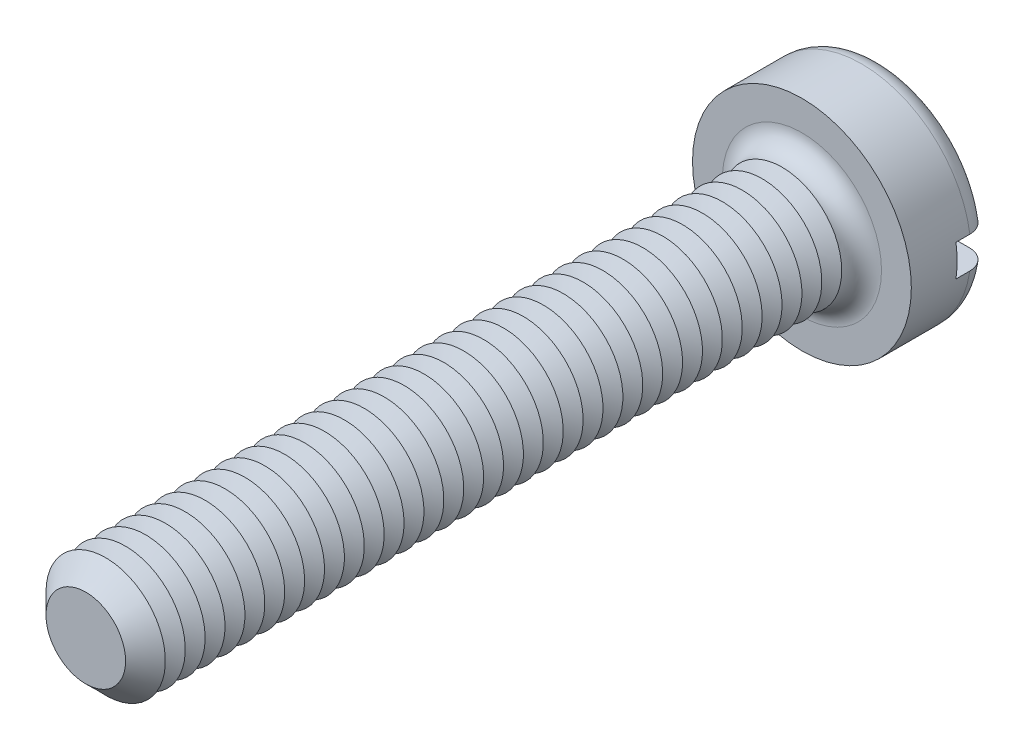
ISO-10303-21;
HEADER;
FILE_DESCRIPTION(('STEP AP214'),'2;1');
FILE_NAME('part.step','',(''),(''),'','','');
FILE_SCHEMA(('AUTOMOTIVE_DESIGN { 1 0 10303 214 1 1 1 1 }'));
ENDSEC;
DATA;
#1=APPLICATION_CONTEXT('core data for automotive mechanical design processes');
#2=APPLICATION_PROTOCOL_DEFINITION('international standard','automotive_design',2000,#1);
#3=PRODUCT_CONTEXT('',#1,'mechanical');
#4=PRODUCT('Part','Part','',(#3));
#5=PRODUCT_RELATED_PRODUCT_CATEGORY('part','',(#4));
#6=PRODUCT_DEFINITION_FORMATION('','',#4);
#7=PRODUCT_DEFINITION_CONTEXT('part definition',#1,'design');
#8=PRODUCT_DEFINITION('design','',#6,#7);
#9=PRODUCT_DEFINITION_SHAPE('','',#8);
#10=(LENGTH_UNIT() NAMED_UNIT(*) SI_UNIT(.MILLI.,.METRE.));
#11=(NAMED_UNIT(*) PLANE_ANGLE_UNIT() SI_UNIT($,.RADIAN.));
#12=(NAMED_UNIT(*) SI_UNIT($,.STERADIAN.) SOLID_ANGLE_UNIT());
#13=UNCERTAINTY_MEASURE_WITH_UNIT(LENGTH_MEASURE(1.E-05),#10,'distance_accuracy_value','');
#14=(GEOMETRIC_REPRESENTATION_CONTEXT(3) GLOBAL_UNCERTAINTY_ASSIGNED_CONTEXT((#13)) GLOBAL_UNIT_ASSIGNED_CONTEXT((#10,
#11,#12)) REPRESENTATION_CONTEXT('',''));
#15=CARTESIAN_POINT('',(0.,0.,0.));
#16=DIRECTION('',(0.,0.,1.));
#17=DIRECTION('',(1.,0.,0.));
#18=AXIS2_PLACEMENT_3D('',#15,#16,#17);
#19=CARTESIAN_POINT('',(0.,0.,-2.));
#20=DIRECTION('',(0.,0.,1.));
#21=DIRECTION('',(1.,0.,0.));
#22=AXIS2_PLACEMENT_3D('',#19,#20,#21);
#23=PLANE('',#22);
#24=CARTESIAN_POINT('',(0.,0.,-2.));
#25=DIRECTION('',(0.,0.,1.));
#26=DIRECTION('',(1.,0.,0.));
#27=AXIS2_PLACEMENT_3D('',#24,#25,#26);
#28=CIRCLE('',#27,2.25);
#29=CARTESIAN_POINT('',(-2.21415898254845,0.4,-2.));
#30=VERTEX_POINT('',#29);
#31=CARTESIAN_POINT('',(2.21415898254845,0.4,-2.));
#32=VERTEX_POINT('',#31);
#33=EDGE_CURVE('E116',#30,#32,#28,.F.);
#34=ORIENTED_EDGE('',*,*,#33,.T.);
#35=DIRECTION('',(1.,0.,0.));
#36=VECTOR('',#35,1.);
#37=CARTESIAN_POINT('',(-2.75,0.400000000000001,-2.));
#38=LINE('',#37,#36);
#39=EDGE_CURVE('E111',#30,#32,#38,.T.);
#40=ORIENTED_EDGE('',*,*,#39,.F.);
#41=EDGE_LOOP('',(#34,#40));
#42=FACE_BOUND('',#41,.T.);
#43=ADVANCED_FACE('F39',(#42),#23,.F.);
#44=CARTESIAN_POINT('',(0.,0.,-1.5));
#45=DIRECTION('',(0.,0.,1.));
#46=DIRECTION('',(1.,0.,0.));
#47=AXIS2_PLACEMENT_3D('',#44,#45,#46);
#48=TOROIDAL_SURFACE('',#47,2.25,0.5);
#49=CARTESIAN_POINT('',(-2.6296588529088,0.400000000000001,-1.78631483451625));
#50=CARTESIAN_POINT('',(-2.61332846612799,0.400000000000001,-1.80942627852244));
#51=CARTESIAN_POINT('',(-2.59501593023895,0.400000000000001,-1.83116426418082));
#52=CARTESIAN_POINT('',(-2.55497423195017,0.400000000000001,-1.87126271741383));
#53=CARTESIAN_POINT('',(-2.53324055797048,0.4,-1.88961865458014));
#54=CARTESIAN_POINT('',(-2.48702796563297,0.4,-1.92241505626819));
#55=CARTESIAN_POINT('',(-2.46255183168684,0.4,-1.93685944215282));
#56=CARTESIAN_POINT('',(-2.41154731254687,0.4,-1.96147315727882));
#57=CARTESIAN_POINT('',(-2.38501943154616,0.4,-1.97164353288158));
#58=CARTESIAN_POINT('',(-2.3303912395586,0.4,-1.98753780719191));
#59=CARTESIAN_POINT('',(-2.30227842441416,0.4,-1.99321871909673));
#60=CARTESIAN_POINT('',(-2.24549884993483,0.4,-1.99984170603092));
#61=CARTESIAN_POINT('',(-2.21683202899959,0.4,-2.00078325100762));
#62=CARTESIAN_POINT('',(-2.15939326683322,0.4,-1.99790249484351));
#63=CARTESIAN_POINT('',(-2.13062419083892,0.4,-1.99402290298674));
#64=CARTESIAN_POINT('',(-2.07413526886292,0.4,-1.98151915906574));
#65=CARTESIAN_POINT('',(-2.04641547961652,0.4,-1.97289475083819));
#66=CARTESIAN_POINT('',(-1.99264697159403,0.4,-1.95107177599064));
#67=CARTESIAN_POINT('',(-1.96660904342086,0.4,-1.93784659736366));
#68=CARTESIAN_POINT('',(-1.91713954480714,0.4,-1.90718730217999));
#69=CARTESIAN_POINT('',(-1.89370795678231,0.4,-1.88975321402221));
#70=CARTESIAN_POINT('',(-1.85029144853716,0.4,-1.85126548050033));
#71=CARTESIAN_POINT('',(-1.83028607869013,0.4,-1.83023492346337));
#72=CARTESIAN_POINT('',(-1.79417432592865,0.4,-1.78505552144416));
#73=CARTESIAN_POINT('',(-1.77806752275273,0.4,-1.76090701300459));
#74=CARTESIAN_POINT('',(-1.75056079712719,0.4,-1.71067721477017));
#75=CARTESIAN_POINT('',(-1.7390748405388,0.4,-1.68464306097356));
#76=CARTESIAN_POINT('',(-1.72075680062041,0.4,-1.63098625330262));
#77=CARTESIAN_POINT('',(-1.71392397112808,0.4,-1.60336385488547));
#78=CARTESIAN_POINT('',(-1.70525661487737,0.4,-1.54801066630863));
#79=CARTESIAN_POINT('',(-1.70330866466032,0.4,-1.52029759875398));
#80=CARTESIAN_POINT('',(-1.70414820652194,0.4,-1.46494458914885));
#81=CARTESIAN_POINT('',(-1.70693532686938,0.4,-1.43730464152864));
#82=CARTESIAN_POINT('',(-1.71709335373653,0.4,-1.38318389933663));
#83=CARTESIAN_POINT('',(-1.72441580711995,0.4,-1.35669397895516));
#84=CARTESIAN_POINT('',(-1.74335830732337,0.4,-1.30529964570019));
#85=CARTESIAN_POINT('',(-1.75497853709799,0.4,-1.2803953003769));
#86=CARTESIAN_POINT('',(-1.78229453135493,0.4,-1.23258298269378));
#87=CARTESIAN_POINT('',(-1.79803217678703,0.4,-1.20969896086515));
#88=CARTESIAN_POINT('',(-1.83304498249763,0.4,-1.16682064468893));
#89=CARTESIAN_POINT('',(-1.85232054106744,0.4,-1.1468266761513));
#90=CARTESIAN_POINT('',(-1.89433695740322,0.4,-1.10980713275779));
#91=CARTESIAN_POINT('',(-1.91714740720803,0.4,-1.09286053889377));
#92=CARTESIAN_POINT('',(-1.96524407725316,0.4,-1.06294809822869));
#93=CARTESIAN_POINT('',(-1.99053056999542,0.4,-1.04998269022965));
#94=CARTESIAN_POINT('',(-2.04340612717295,0.4,-1.02814800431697));
#95=CARTESIAN_POINT('',(-2.07103098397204,0.4,-1.01936532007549));
#96=CARTESIAN_POINT('',(-2.12735840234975,0.4,-1.00652373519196));
#97=CARTESIAN_POINT('',(-2.15606102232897,0.4,-1.00246509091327));
#98=CARTESIAN_POINT('',(-2.21395379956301,0.4,-0.999181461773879));
#99=CARTESIAN_POINT('',(-2.24314598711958,0.4,-0.999992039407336));
#100=CARTESIAN_POINT('',(-2.30097585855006,0.4,-1.00652779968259));
#101=CARTESIAN_POINT('',(-2.32961355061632,0.4,-1.01225290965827));
#102=CARTESIAN_POINT('',(-2.38536238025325,0.4,-1.02843951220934));
#103=CARTESIAN_POINT('',(-2.41248047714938,0.4,-1.03887701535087));
#104=CARTESIAN_POINT('',(-2.46454860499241,0.4,-1.06421009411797));
#105=CARTESIAN_POINT('',(-2.48949875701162,0.4,-1.0791054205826));
#106=CARTESIAN_POINT('',(-2.53620471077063,0.4,-1.11274531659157));
#107=CARTESIAN_POINT('',(-2.55799482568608,0.400000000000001,-1.1314422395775));
#108=CARTESIAN_POINT('',(-2.59807595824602,0.400000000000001,-1.17227176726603));
#109=CARTESIAN_POINT('',(-2.6163672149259,0.400000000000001,-1.19440413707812));
#110=CARTESIAN_POINT('',(-2.64868581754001,0.400000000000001,-1.24117072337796));
#111=CARTESIAN_POINT('',(-2.66276466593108,0.400000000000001,-1.26576935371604));
#112=CARTESIAN_POINT('',(-2.68654482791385,0.400000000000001,-1.31699754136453));
#113=CARTESIAN_POINT('',(-2.69624657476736,0.400000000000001,-1.34362689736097));
#114=CARTESIAN_POINT('',(-2.71090527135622,0.400000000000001,-1.39787706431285));
#115=CARTESIAN_POINT('',(-2.71590826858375,0.400000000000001,-1.4254854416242));
#116=CARTESIAN_POINT('',(-2.72118463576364,0.400000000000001,-1.48115803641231));
#117=CARTESIAN_POINT('',(-2.72145696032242,0.400000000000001,-1.50922235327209));
#118=CARTESIAN_POINT('',(-2.71727180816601,0.400000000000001,-1.56487271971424));
#119=CARTESIAN_POINT('',(-2.71283440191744,0.400000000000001,-1.59246029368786));
#120=CARTESIAN_POINT('',(-2.69939521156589,0.400000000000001,-1.64647499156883));
#121=CARTESIAN_POINT('',(-2.69039909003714,0.400000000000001,-1.67290351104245));
#122=CARTESIAN_POINT('',(-2.67251693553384,0.400000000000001,-1.71382731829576));
#123=CARTESIAN_POINT('',(-2.66497994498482,0.400000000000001,-1.72892686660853));
#124=CARTESIAN_POINT('',(-2.64841616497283,0.400000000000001,-1.75828509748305));
#125=CARTESIAN_POINT('',(-2.63938938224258,0.400000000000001,-1.77254378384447));
#126=CARTESIAN_POINT('',(-2.6296588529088,0.400000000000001,-1.78631483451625));
#127=B_SPLINE_CURVE_WITH_KNOTS('',3,(#49,#50,#51,#52,#53,#54,#55,#56,#57,#58,#59,#60,#61,#62,
#63,#64,#65,#66,#67,#68,#69,#70,#71,#72,#73,#74,#75,#76,#77,#78,#79,#80,#81,#82,#83,#84,#85,#86,
#87,#88,#89,#90,#91,#92,#93,#94,#95,#96,#97,#98,#99,#100,#101,#102,#103,#104,#105,#106,#107,
#108,#109,#110,#111,#112,#113,#114,#115,#116,#117,#118,#119,#120,#121,#122,#123,#124,#125,#126),
.UNSPECIFIED.,.T.,.F.,(4,2,2,2,2,2,2,2,2,2,2,2,2,2,2,2,2,2,2,2,2,2,2,2,2,2,2,2,2,2,2,2,2,2,2,2,
2,2,4),(0.,0.0848338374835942,0.16978050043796,0.254641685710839,0.339482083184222,
0.42512530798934,0.510778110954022,0.597458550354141,0.684143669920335,0.771338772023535,
0.858533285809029,0.945187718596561,1.03183280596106,1.11678035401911,1.20171427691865,
1.28465703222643,1.36759327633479,1.4496584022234,1.53172702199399,1.61466526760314,
1.69761285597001,1.78247103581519,1.86733856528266,1.95389396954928,2.0404540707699,
2.12764713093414,2.21483890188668,2.30159172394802,2.38833969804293,2.4740609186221,
2.55977628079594,2.6443962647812,2.72900787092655,2.81278135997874,2.89657336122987,
2.98000971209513,3.06334267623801,3.113891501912,3.16444009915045),.UNSPECIFIED.);
#128=CARTESIAN_POINT('',(-2.72075357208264,0.400000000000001,-1.50000000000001));
#129=VERTEX_POINT('',#128);
#130=EDGE_CURVE('E451',#129,#30,#127,.T.);
#131=ORIENTED_EDGE('',*,*,#130,.F.);
#132=CARTESIAN_POINT('',(0.,0.,-1.5));
#133=DIRECTION('',(0.,0.,1.));
#134=DIRECTION('',(1.,0.,0.));
#135=AXIS2_PLACEMENT_3D('',#132,#133,#134);
#136=CIRCLE('',#135,2.75);
#137=CARTESIAN_POINT('',(2.7207535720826,0.4,-1.5));
#138=VERTEX_POINT('',#137);
#139=EDGE_CURVE('E125',#138,#129,#136,.T.);
#140=ORIENTED_EDGE('',*,*,#139,.F.);
#141=CARTESIAN_POINT('',(1.7362507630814,0.4,-1.6752840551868));
#142=CARTESIAN_POINT('',(1.74636083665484,0.4,-1.70159961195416));
#143=CARTESIAN_POINT('',(1.7587429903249,0.4,-1.72706707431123));
#144=CARTESIAN_POINT('',(1.78764414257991,0.4,-1.77556609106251));
#145=CARTESIAN_POINT('',(1.80416918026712,0.4,-1.79859401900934));
#146=CARTESIAN_POINT('',(1.84080454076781,0.4,-1.84153587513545));
#147=CARTESIAN_POINT('',(1.86090949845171,0.4,-1.86145438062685));
#148=CARTESIAN_POINT('',(1.9041208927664,0.4,-1.89769607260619));
#149=CARTESIAN_POINT('',(1.92722659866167,0.4,-1.91402013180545));
#150=CARTESIAN_POINT('',(1.97620958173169,0.4,-1.94291288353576));
#151=CARTESIAN_POINT('',(2.00212726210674,0.4,-1.95541309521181));
#152=CARTESIAN_POINT('',(2.05567603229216,0.4,-1.97595143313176));
#153=CARTESIAN_POINT('',(2.08330733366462,0.4,-1.98398900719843));
#154=CARTESIAN_POINT('',(2.13989163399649,0.4,-1.99545904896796));
#155=CARTESIAN_POINT('',(2.16885726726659,0.4,-1.99882930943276));
#156=CARTESIAN_POINT('',(2.22694412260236,0.4,-2.00065872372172));
#157=CARTESIAN_POINT('',(2.25606534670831,0.4,-1.99911781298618));
#158=CARTESIAN_POINT('',(2.31362436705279,0.4,-1.99114818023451));
#159=CARTESIAN_POINT('',(2.34206235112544,0.4,-1.98472081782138));
#160=CARTESIAN_POINT('',(2.39743709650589,0.4,-1.96713601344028));
#161=CARTESIAN_POINT('',(2.42437392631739,0.4,-1.95597878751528));
#162=CARTESIAN_POINT('',(2.47569769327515,0.4,-1.92935960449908));
#163=CARTESIAN_POINT('',(2.50010686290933,0.4,-1.91394052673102));
#164=CARTESIAN_POINT('',(2.54594525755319,0.4,-1.8791725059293));
#165=CARTESIAN_POINT('',(2.56737468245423,0.4,-1.85982382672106));
#166=CARTESIAN_POINT('',(2.60634898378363,0.4,-1.81801641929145));
#167=CARTESIAN_POINT('',(2.6239407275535,0.4,-1.79560138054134));
#168=CARTESIAN_POINT('',(2.65505953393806,0.4,-1.7481077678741));
#169=CARTESIAN_POINT('',(2.66858686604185,0.4,-1.72302937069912));
#170=CARTESIAN_POINT('',(2.69103536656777,0.4,-1.67123055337));
#171=CARTESIAN_POINT('',(2.70000740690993,0.4,-1.64453217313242));
#172=CARTESIAN_POINT('',(2.71330608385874,0.4,-1.59000262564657));
#173=CARTESIAN_POINT('',(2.71763293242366,0.4,-1.5621715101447));
#174=CARTESIAN_POINT('',(2.72149675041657,0.4,-1.50637655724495));
#175=CARTESIAN_POINT('',(2.72106725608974,0.4,-1.47841503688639));
#176=CARTESIAN_POINT('',(2.7155123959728,0.4,-1.42296287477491));
#177=CARTESIAN_POINT('',(2.71038711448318,0.4,-1.39547222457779));
#178=CARTESIAN_POINT('',(2.69560462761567,0.4,-1.34178071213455));
#179=CARTESIAN_POINT('',(2.68595389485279,0.4,-1.31557806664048));
#180=CARTESIAN_POINT('',(2.66240876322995,0.4,-1.26515516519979));
#181=CARTESIAN_POINT('',(2.64851431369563,0.4,-1.24093493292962));
#182=CARTESIAN_POINT('',(2.61681930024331,0.4,-1.19504594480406));
#183=CARTESIAN_POINT('',(2.59900198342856,0.4,-1.17338876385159));
#184=CARTESIAN_POINT('',(2.56001495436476,0.4,-1.13333899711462));
#185=CARTESIAN_POINT('',(2.53884510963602,0.4,-1.11494654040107));
#186=CARTESIAN_POINT('',(2.49354554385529,0.4,-1.08175888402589));
#187=CARTESIAN_POINT('',(2.46938991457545,0.4,-1.06699905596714));
#188=CARTESIAN_POINT('',(2.41896725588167,0.4,-1.04168682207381));
#189=CARTESIAN_POINT('',(2.39270009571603,0.4,-1.03113467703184));
#190=CARTESIAN_POINT('',(2.33844927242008,0.4,-1.01439607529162));
#191=CARTESIAN_POINT('',(2.31044823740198,0.4,-1.00826592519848));
#192=CARTESIAN_POINT('',(2.25381752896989,0.4,-1.00073183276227));
#193=CARTESIAN_POINT('',(2.22518781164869,0.4,-0.999328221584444));
#194=CARTESIAN_POINT('',(2.16774231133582,0.4,-1.00127811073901));
#195=CARTESIAN_POINT('',(2.13892848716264,0.4,-1.00468955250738));
#196=CARTESIAN_POINT('',(2.08227193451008,0.4,-1.01626887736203));
#197=CARTESIAN_POINT('',(2.05442926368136,0.4,-1.02443704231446));
#198=CARTESIAN_POINT('',(2.00032604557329,0.4,-1.04537295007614));
#199=CARTESIAN_POINT('',(1.97407661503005,0.4,-1.05816944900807));
#200=CARTESIAN_POINT('',(1.92411255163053,0.4,-1.08801035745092));
#201=CARTESIAN_POINT('',(1.90039792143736,0.4,-1.10505477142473));
#202=CARTESIAN_POINT('',(1.85633574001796,0.4,-1.14282887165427));
#203=CARTESIAN_POINT('',(1.83597040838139,0.4,-1.16353779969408));
#204=CARTESIAN_POINT('',(1.79908731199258,0.4,-1.20813793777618));
#205=CARTESIAN_POINT('',(1.78256899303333,0.4,-1.23202868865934));
#206=CARTESIAN_POINT('',(1.75420022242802,0.4,-1.28183173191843));
#207=CARTESIAN_POINT('',(1.74226635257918,0.4,-1.30769648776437));
#208=CARTESIAN_POINT('',(1.72302798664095,0.4,-1.36110211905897));
#209=CARTESIAN_POINT('',(1.71572395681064,0.4,-1.38864316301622));
#210=CARTESIAN_POINT('',(1.70611974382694,0.4,-1.44392326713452));
#211=CARTESIAN_POINT('',(1.70370764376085,0.4,-1.47164298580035));
#212=CARTESIAN_POINT('',(1.70363822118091,0.4,-1.52706336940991));
#213=CARTESIAN_POINT('',(1.70597448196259,0.4,-1.55476400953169));
#214=CARTESIAN_POINT('',(1.71335146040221,0.4,-1.59796127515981));
#215=CARTESIAN_POINT('',(1.71686033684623,0.4,-1.61373520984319));
#216=CARTESIAN_POINT('',(1.7254146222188,0.4,-1.64486018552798));
#217=CARTESIAN_POINT('',(1.73045999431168,0.4,-1.66021123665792));
#218=CARTESIAN_POINT('',(1.7362507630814,0.4,-1.6752840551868));
#219=B_SPLINE_CURVE_WITH_KNOTS('',3,(#141,#142,#143,#144,#145,#146,#147,#148,#149,#150,#151,
#152,#153,#154,#155,#156,#157,#158,#159,#160,#161,#162,#163,#164,#165,#166,#167,#168,#169,#170,
#171,#172,#173,#174,#175,#176,#177,#178,#179,#180,#181,#182,#183,#184,#185,#186,#187,#188,#189,
#190,#191,#192,#193,#194,#195,#196,#197,#198,#199,#200,#201,#202,#203,#204,#205,#206,#207,#208,
#209,#210,#211,#212,#213,#214,#215,#216,#217,#218),.UNSPECIFIED.,.T.,.F.,(4,2,2,2,2,2,2,2,2,2,2,
2,2,2,2,2,2,2,2,2,2,2,2,2,2,2,2,2,2,2,2,2,2,2,2,2,2,2,4),(0.,0.0845117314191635,
0.169147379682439,0.253657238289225,0.338146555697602,0.424070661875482,0.510005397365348,
0.597074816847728,0.684145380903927,0.771191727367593,0.858234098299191,0.94443074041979,
1.03062159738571,1.11569223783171,1.20075723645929,1.28485012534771,1.36893917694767,
1.45243570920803,1.53593074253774,1.61930671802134,1.70268368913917,1.7864238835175,
1.87016738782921,1.95469664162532,2.03923113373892,2.12482389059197,2.21042264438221,
2.29706026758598,2.38370302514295,2.47089361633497,2.55808429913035,2.64479602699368,
2.73149525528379,2.81653234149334,2.9015779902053,2.98465497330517,3.06761976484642,
3.11602689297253,3.164432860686),.UNSPECIFIED.);
#220=EDGE_CURVE('E453',#32,#138,#219,.T.);
#221=ORIENTED_EDGE('',*,*,#220,.F.);
#222=ORIENTED_EDGE('',*,*,#33,.F.);
#223=EDGE_LOOP('',(#131,#140,#221,#222));
#224=FACE_BOUND('',#223,.T.);
#225=ADVANCED_FACE('F435',(#224),#48,.T.);
#226=CARTESIAN_POINT('',(0.,0.,-2.));
#227=DIRECTION('',(0.,0.,1.));
#228=DIRECTION('',(1.,0.,0.));
#229=AXIS2_PLACEMENT_3D('',#226,#227,#228);
#230=CYLINDRICAL_SURFACE('',#229,2.75);
#231=DIRECTION('',(0.,0.,1.));
#232=VECTOR('',#231,1.);
#233=CARTESIAN_POINT('',(2.72075357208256,0.4,-2.));
#234=LINE('',#233,#232);
#235=CARTESIAN_POINT('',(2.72075357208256,0.4,-1.15));
#236=VERTEX_POINT('',#235);
#237=EDGE_CURVE('E468',#138,#236,#234,.T.);
#238=ORIENTED_EDGE('',*,*,#237,.F.);
#239=ORIENTED_EDGE('',*,*,#139,.T.);
#240=DIRECTION('',(0.,0.,1.));
#241=VECTOR('',#240,1.);
#242=CARTESIAN_POINT('',(-2.72075357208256,0.4,-2.));
#243=LINE('',#242,#241);
#244=CARTESIAN_POINT('',(-2.72075357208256,0.4,-1.15));
#245=VERTEX_POINT('',#244);
#246=EDGE_CURVE('E63',#245,#129,#243,.F.);
#247=ORIENTED_EDGE('',*,*,#246,.F.);
#248=CARTESIAN_POINT('',(0.,0.,-1.15));
#249=DIRECTION('',(0.,0.,-1.));
#250=DIRECTION('',(-1.,0.,0.));
#251=AXIS2_PLACEMENT_3D('',#248,#249,#250);
#252=CIRCLE('',#251,2.75);
#253=CARTESIAN_POINT('',(-2.72075357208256,-0.4,-1.15));
#254=VERTEX_POINT('',#253);
#255=EDGE_CURVE('E43',#245,#254,#252,.F.);
#256=ORIENTED_EDGE('',*,*,#255,.T.);
#257=DIRECTION('',(0.,0.,1.));
#258=VECTOR('',#257,1.);
#259=CARTESIAN_POINT('',(-2.72075357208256,-0.4,-2.));
#260=LINE('',#259,#258);
#261=CARTESIAN_POINT('',(-2.72075357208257,-0.4,-1.5));
#262=VERTEX_POINT('',#261);
#263=EDGE_CURVE('E465',#262,#254,#260,.T.);
#264=ORIENTED_EDGE('',*,*,#263,.F.);
#265=CARTESIAN_POINT('',(2.72075357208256,-0.4,-1.5));
#266=VERTEX_POINT('',#265);
#267=EDGE_CURVE('E127',#262,#266,#136,.T.);
#268=ORIENTED_EDGE('',*,*,#267,.T.);
#269=DIRECTION('',(0.,0.,1.));
#270=VECTOR('',#269,1.);
#271=CARTESIAN_POINT('',(2.72075357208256,-0.4,-2.));
#272=LINE('',#271,#270);
#273=CARTESIAN_POINT('',(2.72075357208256,-0.4,-1.15));
#274=VERTEX_POINT('',#273);
#275=EDGE_CURVE('E55',#274,#266,#272,.F.);
#276=ORIENTED_EDGE('',*,*,#275,.F.);
#277=EDGE_CURVE('E11',#274,#236,#252,.F.);
#278=ORIENTED_EDGE('',*,*,#277,.T.);
#279=EDGE_LOOP('',(#238,#239,#247,#256,#264,#268,#276,#278));
#280=FACE_BOUND('',#279,.T.);
#281=CARTESIAN_POINT('',(0.,0.,0.));
#282=DIRECTION('',(0.,0.,1.));
#283=DIRECTION('',(1.,0.,0.));
#284=AXIS2_PLACEMENT_3D('',#281,#282,#283);
#285=CIRCLE('',#284,2.75);
#286=CARTESIAN_POINT('',(2.75,0.,0.));
#287=VERTEX_POINT('',#286);
#288=EDGE_CURVE('E471',#287,#287,#285,.T.);
#289=ORIENTED_EDGE('',*,*,#288,.F.);
#290=EDGE_LOOP('',(#289));
#291=FACE_BOUND('',#290,.T.);
#292=ADVANCED_FACE('F431',(#280,#291),#230,.T.);
#293=CARTESIAN_POINT('',(2.21415898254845,-0.4,-2.));
#294=VERTEX_POINT('',#293);
#295=CARTESIAN_POINT('',(-2.21415898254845,-0.4,-2.));
#296=VERTEX_POINT('',#295);
#297=EDGE_CURVE('E109',#294,#296,#28,.F.);
#298=ORIENTED_EDGE('',*,*,#297,.T.);
#299=DIRECTION('',(-1.,0.,0.));
#300=VECTOR('',#299,1.);
#301=CARTESIAN_POINT('',(-2.75,-0.4,-2.));
#302=LINE('',#301,#300);
#303=EDGE_CURVE('E96',#294,#296,#302,.T.);
#304=ORIENTED_EDGE('',*,*,#303,.F.);
#305=EDGE_LOOP('',(#298,#304));
#306=FACE_BOUND('',#305,.T.);
#307=ADVANCED_FACE('F108',(#306),#23,.F.);
#308=CARTESIAN_POINT('',(0.,0.,0.));
#309=DIRECTION('',(0.,0.,1.));
#310=DIRECTION('',(1.,0.,0.));
#311=AXIS2_PLACEMENT_3D('',#308,#309,#310);
#312=PLANE('',#311);
#313=CARTESIAN_POINT('',(0.,0.,0.));
#314=DIRECTION('',(0.,0.,1.));
#315=DIRECTION('',(1.,0.,0.));
#316=AXIS2_PLACEMENT_3D('',#313,#314,#315);
#317=CIRCLE('',#316,2.);
#318=CARTESIAN_POINT('',(2.,0.,0.));
#319=VERTEX_POINT('',#318);
#320=EDGE_CURVE('E115',#319,#319,#317,.F.);
#321=ORIENTED_EDGE('',*,*,#320,.T.);
#322=EDGE_LOOP('',(#321));
#323=FACE_BOUND('',#322,.T.);
#324=ORIENTED_EDGE('',*,*,#288,.T.);
#325=EDGE_LOOP('',(#324));
#326=FACE_BOUND('',#325,.T.);
#327=ADVANCED_FACE('F430',(#323,#326),#312,.T.);
#328=CARTESIAN_POINT('',(-2.6296588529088,-0.4,-1.78631483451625));
#329=CARTESIAN_POINT('',(-2.64575286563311,-0.4,-1.76353353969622));
#330=CARTESIAN_POINT('',(-2.65994473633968,-0.4,-1.73938506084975));
#331=CARTESIAN_POINT('',(-2.68408879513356,-0.4,-1.68903091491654));
#332=CARTESIAN_POINT('',(-2.69403633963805,-0.4,-1.6628230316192));
#333=CARTESIAN_POINT('',(-2.70937899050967,-0.4,-1.60911025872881));
#334=CARTESIAN_POINT('',(-2.71477511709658,-0.4,-1.5816056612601));
#335=CARTESIAN_POINT('',(-2.72085365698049,-0.4,-1.52608718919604));
#336=CARTESIAN_POINT('',(-2.7215371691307,-0.4,-1.49807343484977));
#337=CARTESIAN_POINT('',(-2.71817903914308,-0.4,-1.44242333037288));
#338=CARTESIAN_POINT('',(-2.71415291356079,-0.4,-1.41478604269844));
#339=CARTESIAN_POINT('',(-2.70152104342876,-0.4,-1.36057835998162));
#340=CARTESIAN_POINT('',(-2.69291517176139,-0.4,-1.33400799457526));
#341=CARTESIAN_POINT('',(-2.67137052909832,-0.4,-1.28266198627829));
#342=CARTESIAN_POINT('',(-2.65842829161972,-0.4,-1.25788779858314));
#343=CARTESIAN_POINT('',(-2.62859348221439,-0.4,-1.21084577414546));
#344=CARTESIAN_POINT('',(-2.61170082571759,-0.4,-1.18857799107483));
#345=CARTESIAN_POINT('',(-2.5743351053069,-0.4,-1.1470221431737));
#346=CARTESIAN_POINT('',(-2.55383974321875,-0.4,-1.12775413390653));
#347=CARTESIAN_POINT('',(-2.5099353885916,-0.4,-1.09288845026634));
#348=CARTESIAN_POINT('',(-2.48652625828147,-0.4,-1.07729094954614));
#349=CARTESIAN_POINT('',(-2.43718903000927,-0.4,-1.0500239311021));
#350=CARTESIAN_POINT('',(-2.41123629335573,-0.4,-1.0383990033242));
#351=CARTESIAN_POINT('',(-2.35776417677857,-0.4,-1.01960886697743));
#352=CARTESIAN_POINT('',(-2.33024469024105,-0.4,-1.01244396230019));
#353=CARTESIAN_POINT('',(-2.27404134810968,-0.4,-1.00268156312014));
#354=CARTESIAN_POINT('',(-2.24534705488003,-0.4,-1.00014414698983));
#355=CARTESIAN_POINT('',(-2.18793513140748,-0.4,-0.999867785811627));
#356=CARTESIAN_POINT('',(-2.15921749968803,-0.4,-1.00212917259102));
#357=CARTESIAN_POINT('',(-2.10225052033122,-0.4,-1.01142552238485));
#358=CARTESIAN_POINT('',(-2.07400941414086,-0.4,-1.01851105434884));
#359=CARTESIAN_POINT('',(-2.01911044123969,-0.4,-1.03730994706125));
#360=CARTESIAN_POINT('',(-1.99245264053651,-0.4,-1.04902350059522));
#361=CARTESIAN_POINT('',(-1.94142108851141,-0.4,-1.07679847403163));
#362=CARTESIAN_POINT('',(-1.91705303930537,-0.4,-1.09287038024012));
#363=CARTESIAN_POINT('',(-1.87139758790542,-0.4,-1.12891897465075));
#364=CARTESIAN_POINT('',(-1.85011007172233,-0.4,-1.14889551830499));
#365=CARTESIAN_POINT('',(-1.81149058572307,-0.4,-1.19196940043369));
#366=CARTESIAN_POINT('',(-1.79411779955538,-0.4,-1.21503011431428));
#367=CARTESIAN_POINT('',(-1.76359546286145,-0.4,-1.26379588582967));
#368=CARTESIAN_POINT('',(-1.75044532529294,-0.4,-1.28950057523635));
#369=CARTESIAN_POINT('',(-1.72906221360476,-0.4,-1.3422057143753));
#370=CARTESIAN_POINT('',(-1.72072512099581,-0.4,-1.3691639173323));
#371=CARTESIAN_POINT('',(-1.70880448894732,-0.4,-1.42411084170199));
#372=CARTESIAN_POINT('',(-1.7052202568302,-0.4,-1.45209941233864));
#373=CARTESIAN_POINT('',(-1.70295553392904,-0.4,-1.50768522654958));
#374=CARTESIAN_POINT('',(-1.70417398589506,-0.4,-1.53527840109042));
#375=CARTESIAN_POINT('',(-1.71124536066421,-0.4,-1.58986292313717));
#376=CARTESIAN_POINT('',(-1.71709811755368,-0.4,-1.61685429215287));
#377=CARTESIAN_POINT('',(-1.73321132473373,-0.4,-1.66938107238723));
#378=CARTESIAN_POINT('',(-1.74345625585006,-0.4,-1.69492125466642));
#379=CARTESIAN_POINT('',(-1.76802111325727,-0.4,-1.74395877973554));
#380=CARTESIAN_POINT('',(-1.78234133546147,-0.4,-1.76745597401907));
#381=CARTESIAN_POINT('',(-1.81488631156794,-0.4,-1.81216193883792));
#382=CARTESIAN_POINT('',(-1.83317116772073,-0.4,-1.83332693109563));
#383=CARTESIAN_POINT('',(-1.87296030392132,-0.4,-1.872375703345));
#384=CARTESIAN_POINT('',(-1.89446497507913,-0.4,-1.89025908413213));
#385=CARTESIAN_POINT('',(-1.94063077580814,-0.4,-1.92267732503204));
#386=CARTESIAN_POINT('',(-1.96535444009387,-0.4,-1.93712316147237));
#387=CARTESIAN_POINT('',(-2.01684705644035,-0.4,-1.96173690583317));
#388=CARTESIAN_POINT('',(-2.04361620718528,-0.4,-1.97190439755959));
#389=CARTESIAN_POINT('',(-2.09891021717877,-0.4,-1.9878230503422));
#390=CARTESIAN_POINT('',(-2.12745653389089,-0.4,-1.99349978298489));
#391=CARTESIAN_POINT('',(-2.18509639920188,-0.4,-1.99999556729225));
#392=CARTESIAN_POINT('',(-2.21418994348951,-0.4,-2.00081465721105));
#393=CARTESIAN_POINT('',(-2.27218032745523,-0.4,-1.99755156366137));
#394=CARTESIAN_POINT('',(-2.30107643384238,-0.4,-1.99345627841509));
#395=CARTESIAN_POINT('',(-2.35776697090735,-0.4,-1.98043125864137));
#396=CARTESIAN_POINT('',(-2.38556116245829,-0.4,-1.97150048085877));
#397=CARTESIAN_POINT('',(-2.43901832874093,-0.4,-1.94912081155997));
#398=CARTESIAN_POINT('',(-2.46469578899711,-0.4,-1.93570648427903));
#399=CARTESIAN_POINT('',(-2.51337022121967,-0.4,-1.90471183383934));
#400=CARTESIAN_POINT('',(-2.53637056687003,-0.4,-1.88713684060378));
#401=CARTESIAN_POINT('',(-2.57111030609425,-0.4,-1.85552084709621));
#402=CARTESIAN_POINT('',(-2.58386709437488,-0.4,-1.84257896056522));
#403=CARTESIAN_POINT('',(-2.60790410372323,-0.4,-1.81538935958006));
#404=CARTESIAN_POINT('',(-2.61918433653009,-0.4,-1.80114165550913));
#405=CARTESIAN_POINT('',(-2.6296588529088,-0.4,-1.78631483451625));
#406=B_SPLINE_CURVE_WITH_KNOTS('',3,(#328,#329,#330,#331,#332,#333,#334,#335,#336,#337,#338,
#339,#340,#341,#342,#343,#344,#345,#346,#347,#348,#349,#350,#351,#352,#353,#354,#355,#356,#357,
#358,#359,#360,#361,#362,#363,#364,#365,#366,#367,#368,#369,#370,#371,#372,#373,#374,#375,#376,
#377,#378,#379,#380,#381,#382,#383,#384,#385,#386,#387,#388,#389,#390,#391,#392,#393,#394,#395,
#396,#397,#398,#399,#400,#401,#402,#403,#404,#405),.UNSPECIFIED.,.T.,.F.,(4,2,2,2,2,2,2,2,2,2,2,
2,2,2,2,2,2,2,2,2,2,2,2,2,2,2,2,2,2,2,2,2,2,2,2,2,2,2,4),(0.,0.0836125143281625,
0.167316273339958,0.251001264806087,0.334666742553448,0.418057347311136,0.501450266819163,
0.584910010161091,0.668371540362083,0.752369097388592,0.836370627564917,0.921286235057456,
1.00620762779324,1.09222390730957,1.17824613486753,1.26518425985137,1.35212600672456,
1.43927882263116,1.52642841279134,1.61262232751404,1.69880425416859,1.7830443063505,
1.86727208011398,1.9497371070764,2.03219918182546,2.1143722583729,2.19655130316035,
2.28007615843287,2.36361116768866,2.44911836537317,2.53463387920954,2.62153862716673,
2.70844269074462,2.79557895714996,2.88273403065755,2.96923214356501,3.05562004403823,
3.11003826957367,3.16445606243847),.UNSPECIFIED.);
#407=EDGE_CURVE('E103',#296,#262,#406,.T.);
#408=ORIENTED_EDGE('',*,*,#407,.F.);
#409=ORIENTED_EDGE('',*,*,#297,.F.);
#410=CARTESIAN_POINT('',(1.7362507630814,-0.4,-1.6752840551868));
#411=CARTESIAN_POINT('',(1.72641416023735,-0.4,-1.64967314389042));
#412=CARTESIAN_POINT('',(1.71871480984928,-0.4,-1.62322216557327));
#413=CARTESIAN_POINT('',(1.70786038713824,-0.4,-1.56938399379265));
#414=CARTESIAN_POINT('',(1.70470970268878,-0.4,-1.54199592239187));
#415=CARTESIAN_POINT('',(1.70306971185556,-0.4,-1.48708393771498));
#416=CARTESIAN_POINT('',(1.70457942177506,-0.4,-1.45956005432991));
#417=CARTESIAN_POINT('',(1.71220670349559,-0.4,-1.40516538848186));
#418=CARTESIAN_POINT('',(1.71832341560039,-0.4,-1.3782944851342));
#419=CARTESIAN_POINT('',(1.73494792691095,-0.4,-1.32598312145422));
#420=CARTESIAN_POINT('',(1.74545076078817,-0.4,-1.30054108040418));
#421=CARTESIAN_POINT('',(1.77051013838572,-0.4,-1.25173932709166));
#422=CARTESIAN_POINT('',(1.7850670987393,-0.4,-1.22837982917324));
#423=CARTESIAN_POINT('',(1.81806903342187,-0.4,-1.1839775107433));
#424=CARTESIAN_POINT('',(1.8365752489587,-0.4,-1.16298023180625));
#425=CARTESIAN_POINT('',(1.87677669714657,-0.4,-1.1243010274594));
#426=CARTESIAN_POINT('',(1.89847230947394,-0.4,-1.10661949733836));
#427=CARTESIAN_POINT('',(1.94498854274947,-0.4,-1.07463966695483));
#428=CARTESIAN_POINT('',(1.96987078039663,-0.4,-1.06043095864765));
#429=CARTESIAN_POINT('',(2.02163980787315,-0.4,-1.0363161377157));
#430=CARTESIAN_POINT('',(2.04852678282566,-0.4,-1.02641042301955));
#431=CARTESIAN_POINT('',(2.10400319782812,-0.4,-1.01104128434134));
#432=CARTESIAN_POINT('',(2.13261287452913,-0.4,-1.00565079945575));
#433=CARTESIAN_POINT('',(2.19033179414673,-0.4,-0.999735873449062));
#434=CARTESIAN_POINT('',(2.2194410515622,-0.4,-0.999211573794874));
#435=CARTESIAN_POINT('',(2.27740442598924,-0.4,-1.00306591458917));
#436=CARTESIAN_POINT('',(2.30625777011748,-0.4,-1.00745623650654));
#437=CARTESIAN_POINT('',(2.36280530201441,-0.4,-1.02105937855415));
#438=CARTESIAN_POINT('',(2.39049952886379,-0.4,-1.03027203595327));
#439=CARTESIAN_POINT('',(2.44369359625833,-0.4,-1.05318710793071));
#440=CARTESIAN_POINT('',(2.46920965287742,-0.4,-1.0668518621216));
#441=CARTESIAN_POINT('',(2.51754507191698,-0.4,-1.09832423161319));
#442=CARTESIAN_POINT('',(2.54036461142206,-0.4,-1.11613157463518));
#443=CARTESIAN_POINT('',(2.58234752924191,-0.4,-1.15513986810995));
#444=CARTESIAN_POINT('',(2.601553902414,-0.4,-1.1762945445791));
#445=CARTESIAN_POINT('',(2.63609001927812,-0.4,-1.22156192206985));
#446=CARTESIAN_POINT('',(2.65142002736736,-0.4,-1.24567442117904));
#447=CARTESIAN_POINT('',(2.67757733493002,-0.4,-1.29585881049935));
#448=CARTESIAN_POINT('',(2.68845668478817,-0.4,-1.32190357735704));
#449=CARTESIAN_POINT('',(2.7056478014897,-0.4,-1.375459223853));
#450=CARTESIAN_POINT('',(2.71195980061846,-0.4,-1.40297002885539));
#451=CARTESIAN_POINT('',(2.71979288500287,-0.4,-1.45843707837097));
#452=CARTESIAN_POINT('',(2.72135241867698,-0.4,-1.48638789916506));
#453=CARTESIAN_POINT('',(2.71974298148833,-0.4,-1.54215266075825));
#454=CARTESIAN_POINT('',(2.71657412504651,-0.4,-1.56996660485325));
#455=CARTESIAN_POINT('',(2.70561779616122,-0.4,-1.62459191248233));
#456=CARTESIAN_POINT('',(2.69784258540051,-0.4,-1.65140573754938));
#457=CARTESIAN_POINT('',(2.6779146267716,-0.4,-1.70335337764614));
#458=CARTESIAN_POINT('',(2.66576185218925,-0.4,-1.72848718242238));
#459=CARTESIAN_POINT('',(2.63739107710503,-0.4,-1.77645196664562));
#460=CARTESIAN_POINT('',(2.62116029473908,-0.4,-1.79927538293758));
#461=CARTESIAN_POINT('',(2.58512700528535,-0.4,-1.84190182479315));
#462=CARTESIAN_POINT('',(2.56532438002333,-0.4,-1.86170475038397));
#463=CARTESIAN_POINT('',(2.522535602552,-0.4,-1.89791219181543));
#464=CARTESIAN_POINT('',(2.49952399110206,-0.4,-1.91428661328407));
#465=CARTESIAN_POINT('',(2.45110500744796,-0.4,-1.94299324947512));
#466=CARTESIAN_POINT('',(2.4256974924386,-0.4,-1.95532522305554));
#467=CARTESIAN_POINT('',(2.37288090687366,-0.4,-1.97575769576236));
#468=CARTESIAN_POINT('',(2.34545135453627,-0.4,-1.98380524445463));
#469=CARTESIAN_POINT('',(2.28963821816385,-0.4,-1.99524443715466));
#470=CARTESIAN_POINT('',(2.26125456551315,-0.4,-1.99863574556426));
#471=CARTESIAN_POINT('',(2.20395671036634,-0.4,-2.00070487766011));
#472=CARTESIAN_POINT('',(2.17504033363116,-0.4,-1.99932265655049));
#473=CARTESIAN_POINT('',(2.11784130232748,-0.4,-1.9917648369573));
#474=CARTESIAN_POINT('',(2.08955866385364,-0.4,-1.98558911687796));
#475=CARTESIAN_POINT('',(2.03419451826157,-0.4,-1.96854979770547));
#476=CARTESIAN_POINT('',(2.00712437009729,-0.4,-1.95764925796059));
#477=CARTESIAN_POINT('',(1.95519572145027,-0.4,-1.93144413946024));
#478=CARTESIAN_POINT('',(1.93033780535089,-0.4,-1.91613840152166));
#479=CARTESIAN_POINT('',(1.88362525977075,-0.4,-1.88157419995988));
#480=CARTESIAN_POINT('',(1.86176428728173,-0.4,-1.86232430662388));
#481=CARTESIAN_POINT('',(1.82167218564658,-0.4,-1.82038600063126));
#482=CARTESIAN_POINT('',(1.803436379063,-0.4,-1.7977020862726));
#483=CARTESIAN_POINT('',(1.77700088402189,-0.4,-1.7582526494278));
#484=CARTESIAN_POINT('',(1.7675549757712,-0.4,-1.74230781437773));
#485=CARTESIAN_POINT('',(1.75049861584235,-0.4,-1.70946415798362));
#486=CARTESIAN_POINT('',(1.7428881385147,-0.4,-1.69256534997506));
#487=CARTESIAN_POINT('',(1.7362507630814,-0.4,-1.6752840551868));
#488=B_SPLINE_CURVE_WITH_KNOTS('',3,(#410,#411,#412,#413,#414,#415,#416,#417,#418,#419,#420,
#421,#422,#423,#424,#425,#426,#427,#428,#429,#430,#431,#432,#433,#434,#435,#436,#437,#438,#439,
#440,#441,#442,#443,#444,#445,#446,#447,#448,#449,#450,#451,#452,#453,#454,#455,#456,#457,#458,
#459,#460,#461,#462,#463,#464,#465,#466,#467,#468,#469,#470,#471,#472,#473,#474,#475,#476,#477,
#478,#479,#480,#481,#482,#483,#484,#485,#486,#487),.UNSPECIFIED.,.T.,.F.,(4,2,2,2,2,2,2,2,2,2,2,
2,2,2,2,2,2,2,2,2,2,2,2,2,2,2,2,2,2,2,2,2,2,2,2,2,2,2,4),(0.,0.0822382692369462,
0.164555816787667,0.246855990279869,0.329140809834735,0.411332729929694,0.493533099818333,
0.577115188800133,0.660707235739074,0.746270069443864,0.831840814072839,0.918768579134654,
1.00569887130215,1.09283622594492,1.17997064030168,1.26638632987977,1.35279634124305,
1.43810213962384,1.52340211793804,1.60767384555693,1.69194128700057,1.77552515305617,
1.85910699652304,1.94246734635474,2.02582820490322,2.10945367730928,2.19308191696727,
2.2774160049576,2.36175512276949,2.4471137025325,2.53247843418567,2.61892083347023,
2.70536542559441,2.79249842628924,2.87965437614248,2.96662291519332,3.05347850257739,
3.10897061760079,3.16446195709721),.UNSPECIFIED.);
#489=EDGE_CURVE('E92',#266,#294,#488,.T.);
#490=ORIENTED_EDGE('',*,*,#489,.F.);
#491=ORIENTED_EDGE('',*,*,#267,.F.);
#492=EDGE_LOOP('',(#408,#409,#490,#491));
#493=FACE_BOUND('',#492,.T.);
#494=ADVANCED_FACE('F113',(#493),#48,.T.);
#495=CARTESIAN_POINT('',(0.,0.,0.5));
#496=DIRECTION('',(0.,0.,1.));
#497=DIRECTION('',(1.,0.,0.));
#498=AXIS2_PLACEMENT_3D('',#495,#496,#497);
#499=TOROIDAL_SURFACE('',#498,2.,0.5);
#500=ORIENTED_EDGE('',*,*,#320,.F.);
#501=EDGE_LOOP('',(#500));
#502=FACE_BOUND('',#501,.T.);
#503=CARTESIAN_POINT('',(0.,0.,0.5));
#504=DIRECTION('',(0.,0.,-1.));
#505=DIRECTION('',(-1.,0.,0.));
#506=AXIS2_PLACEMENT_3D('',#503,#504,#505);
#507=CIRCLE('',#506,1.5);
#508=CARTESIAN_POINT('',(-1.5,0.,0.5));
#509=VERTEX_POINT('',#508);
#510=EDGE_CURVE('E476',#509,#509,#507,.T.);
#511=ORIENTED_EDGE('',*,*,#510,.T.);
#512=EDGE_LOOP('',(#511));
#513=FACE_BOUND('',#512,.T.);
#514=ADVANCED_FACE('F423',(#502,#513),#499,.F.);
#515=CARTESIAN_POINT('',(0.,0.,0.750000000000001));
#516=DIRECTION('',(0.,0.,-1.));
#517=DIRECTION('',(-1.,0.,0.));
#518=AXIS2_PLACEMENT_3D('',#515,#516,#517);
#519=CONICAL_SURFACE('',#518,1.06698729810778,1.0471975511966);
#520=ORIENTED_EDGE('',*,*,#510,.F.);
#521=EDGE_LOOP('',(#520));
#522=FACE_BOUND('',#521,.T.);
#523=CARTESIAN_POINT('',(0.,0.,0.750000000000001));
#524=DIRECTION('',(0.,0.,-1.));
#525=DIRECTION('',(-1.,0.,0.));
#526=AXIS2_PLACEMENT_3D('',#523,#524,#525);
#527=CIRCLE('',#526,1.06698729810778);
#528=CARTESIAN_POINT('',(-1.06698729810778,0.,0.750000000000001));
#529=VERTEX_POINT('',#528);
#530=EDGE_CURVE('E481',#529,#529,#527,.T.);
#531=ORIENTED_EDGE('',*,*,#530,.T.);
#532=EDGE_LOOP('',(#531));
#533=FACE_BOUND('',#532,.T.);
#534=ADVANCED_FACE('F419',(#522,#533),#519,.T.);
#535=CARTESIAN_POINT('',(0.,0.,1.));
#536=DIRECTION('',(0.,0.,1.));
#537=DIRECTION('',(1.,0.,0.));
#538=AXIS2_PLACEMENT_3D('',#535,#536,#537);
#539=CONICAL_SURFACE('',#538,1.5,1.0471975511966);
#540=ORIENTED_EDGE('',*,*,#530,.F.);
#541=EDGE_LOOP('',(#540));
#542=FACE_BOUND('',#541,.T.);
#543=CARTESIAN_POINT('',(0.,0.,1.));
#544=DIRECTION('',(0.,0.,-1.));
#545=DIRECTION('',(-1.,0.,0.));
#546=AXIS2_PLACEMENT_3D('',#543,#544,#545);
#547=CIRCLE('',#546,1.5);
#548=CARTESIAN_POINT('',(-1.5,0.,1.));
#549=VERTEX_POINT('',#548);
#550=EDGE_CURVE('E487',#549,#549,#547,.T.);
#551=ORIENTED_EDGE('',*,*,#550,.T.);
#552=EDGE_LOOP('',(#551));
#553=FACE_BOUND('',#552,.T.);
#554=ADVANCED_FACE('F415',(#542,#553),#539,.T.);
#555=CARTESIAN_POINT('',(0.,0.,1.25));
#556=DIRECTION('',(0.,0.,-1.));
#557=DIRECTION('',(-1.,0.,0.));
#558=AXIS2_PLACEMENT_3D('',#555,#556,#557);
#559=CONICAL_SURFACE('',#558,1.06698729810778,1.0471975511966);
#560=ORIENTED_EDGE('',*,*,#550,.F.);
#561=EDGE_LOOP('',(#560));
#562=FACE_BOUND('',#561,.T.);
#563=CARTESIAN_POINT('',(0.,0.,1.25));
#564=DIRECTION('',(0.,0.,-1.));
#565=DIRECTION('',(-1.,0.,0.));
#566=AXIS2_PLACEMENT_3D('',#563,#564,#565);
#567=CIRCLE('',#566,1.06698729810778);
#568=CARTESIAN_POINT('',(-1.06698729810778,0.,1.25));
#569=VERTEX_POINT('',#568);
#570=EDGE_CURVE('E491',#569,#569,#567,.T.);
#571=ORIENTED_EDGE('',*,*,#570,.T.);
#572=EDGE_LOOP('',(#571));
#573=FACE_BOUND('',#572,.T.);
#574=ADVANCED_FACE('F411',(#562,#573),#559,.T.);
#575=CARTESIAN_POINT('',(0.,0.,1.5));
#576=DIRECTION('',(0.,0.,1.));
#577=DIRECTION('',(1.,0.,0.));
#578=AXIS2_PLACEMENT_3D('',#575,#576,#577);
#579=CONICAL_SURFACE('',#578,1.5,1.0471975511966);
#580=ORIENTED_EDGE('',*,*,#570,.F.);
#581=EDGE_LOOP('',(#580));
#582=FACE_BOUND('',#581,.T.);
#583=CARTESIAN_POINT('',(0.,0.,1.5));
#584=DIRECTION('',(0.,0.,-1.));
#585=DIRECTION('',(-1.,0.,0.));
#586=AXIS2_PLACEMENT_3D('',#583,#584,#585);
#587=CIRCLE('',#586,1.5);
#588=CARTESIAN_POINT('',(-1.5,0.,1.5));
#589=VERTEX_POINT('',#588);
#590=EDGE_CURVE('E494',#589,#589,#587,.T.);
#591=ORIENTED_EDGE('',*,*,#590,.T.);
#592=EDGE_LOOP('',(#591));
#593=FACE_BOUND('',#592,.T.);
#594=ADVANCED_FACE('F407',(#582,#593),#579,.T.);
#595=CARTESIAN_POINT('',(0.,0.,1.75));
#596=DIRECTION('',(0.,0.,-1.));
#597=DIRECTION('',(-1.,0.,0.));
#598=AXIS2_PLACEMENT_3D('',#595,#596,#597);
#599=CONICAL_SURFACE('',#598,1.06698729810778,1.0471975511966);
#600=ORIENTED_EDGE('',*,*,#590,.F.);
#601=EDGE_LOOP('',(#600));
#602=FACE_BOUND('',#601,.T.);
#603=CARTESIAN_POINT('',(0.,0.,1.75));
#604=DIRECTION('',(0.,0.,-1.));
#605=DIRECTION('',(-1.,0.,0.));
#606=AXIS2_PLACEMENT_3D('',#603,#604,#605);
#607=CIRCLE('',#606,1.06698729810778);
#608=CARTESIAN_POINT('',(-1.06698729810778,0.,1.75));
#609=VERTEX_POINT('',#608);
#610=EDGE_CURVE('E498',#609,#609,#607,.T.);
#611=ORIENTED_EDGE('',*,*,#610,.T.);
#612=EDGE_LOOP('',(#611));
#613=FACE_BOUND('',#612,.T.);
#614=ADVANCED_FACE('F403',(#602,#613),#599,.T.);
#615=CARTESIAN_POINT('',(0.,0.,2.));
#616=DIRECTION('',(0.,0.,1.));
#617=DIRECTION('',(1.,0.,0.));
#618=AXIS2_PLACEMENT_3D('',#615,#616,#617);
#619=CONICAL_SURFACE('',#618,1.5,1.0471975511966);
#620=ORIENTED_EDGE('',*,*,#610,.F.);
#621=EDGE_LOOP('',(#620));
#622=FACE_BOUND('',#621,.T.);
#623=CARTESIAN_POINT('',(0.,0.,2.));
#624=DIRECTION('',(0.,0.,-1.));
#625=DIRECTION('',(-1.,0.,0.));
#626=AXIS2_PLACEMENT_3D('',#623,#624,#625);
#627=CIRCLE('',#626,1.5);
#628=CARTESIAN_POINT('',(-1.5,0.,2.));
#629=VERTEX_POINT('',#628);
#630=EDGE_CURVE('E502',#629,#629,#627,.T.);
#631=ORIENTED_EDGE('',*,*,#630,.T.);
#632=EDGE_LOOP('',(#631));
#633=FACE_BOUND('',#632,.T.);
#634=ADVANCED_FACE('F399',(#622,#633),#619,.T.);
#635=CARTESIAN_POINT('',(0.,0.,2.25));
#636=DIRECTION('',(0.,0.,-1.));
#637=DIRECTION('',(-1.,0.,0.));
#638=AXIS2_PLACEMENT_3D('',#635,#636,#637);
#639=CONICAL_SURFACE('',#638,1.06698729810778,1.0471975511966);
#640=ORIENTED_EDGE('',*,*,#630,.F.);
#641=EDGE_LOOP('',(#640));
#642=FACE_BOUND('',#641,.T.);
#643=CARTESIAN_POINT('',(0.,0.,2.25));
#644=DIRECTION('',(0.,0.,-1.));
#645=DIRECTION('',(-1.,0.,0.));
#646=AXIS2_PLACEMENT_3D('',#643,#644,#645);
#647=CIRCLE('',#646,1.06698729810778);
#648=CARTESIAN_POINT('',(-1.06698729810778,0.,2.25));
#649=VERTEX_POINT('',#648);
#650=EDGE_CURVE('E506',#649,#649,#647,.T.);
#651=ORIENTED_EDGE('',*,*,#650,.T.);
#652=EDGE_LOOP('',(#651));
#653=FACE_BOUND('',#652,.T.);
#654=ADVANCED_FACE('F395',(#642,#653),#639,.T.);
#655=CARTESIAN_POINT('',(0.,0.,2.5));
#656=DIRECTION('',(0.,0.,1.));
#657=DIRECTION('',(1.,0.,0.));
#658=AXIS2_PLACEMENT_3D('',#655,#656,#657);
#659=CONICAL_SURFACE('',#658,1.5,1.0471975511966);
#660=ORIENTED_EDGE('',*,*,#650,.F.);
#661=EDGE_LOOP('',(#660));
#662=FACE_BOUND('',#661,.T.);
#663=CARTESIAN_POINT('',(0.,0.,2.5));
#664=DIRECTION('',(0.,0.,-1.));
#665=DIRECTION('',(-1.,0.,0.));
#666=AXIS2_PLACEMENT_3D('',#663,#664,#665);
#667=CIRCLE('',#666,1.5);
#668=CARTESIAN_POINT('',(-1.5,0.,2.5));
#669=VERTEX_POINT('',#668);
#670=EDGE_CURVE('E510',#669,#669,#667,.T.);
#671=ORIENTED_EDGE('',*,*,#670,.T.);
#672=EDGE_LOOP('',(#671));
#673=FACE_BOUND('',#672,.T.);
#674=ADVANCED_FACE('F391',(#662,#673),#659,.T.);
#675=CARTESIAN_POINT('',(0.,0.,2.75));
#676=DIRECTION('',(0.,0.,-1.));
#677=DIRECTION('',(-1.,0.,0.));
#678=AXIS2_PLACEMENT_3D('',#675,#676,#677);
#679=CONICAL_SURFACE('',#678,1.06698729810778,1.0471975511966);
#680=ORIENTED_EDGE('',*,*,#670,.F.);
#681=EDGE_LOOP('',(#680));
#682=FACE_BOUND('',#681,.T.);
#683=CARTESIAN_POINT('',(0.,0.,2.75));
#684=DIRECTION('',(0.,0.,-1.));
#685=DIRECTION('',(-1.,0.,0.));
#686=AXIS2_PLACEMENT_3D('',#683,#684,#685);
#687=CIRCLE('',#686,1.06698729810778);
#688=CARTESIAN_POINT('',(-1.06698729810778,0.,2.75));
#689=VERTEX_POINT('',#688);
#690=EDGE_CURVE('E514',#689,#689,#687,.T.);
#691=ORIENTED_EDGE('',*,*,#690,.T.);
#692=EDGE_LOOP('',(#691));
#693=FACE_BOUND('',#692,.T.);
#694=ADVANCED_FACE('F387',(#682,#693),#679,.T.);
#695=CARTESIAN_POINT('',(0.,0.,3.));
#696=DIRECTION('',(0.,0.,1.));
#697=DIRECTION('',(1.,0.,0.));
#698=AXIS2_PLACEMENT_3D('',#695,#696,#697);
#699=CONICAL_SURFACE('',#698,1.5,1.0471975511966);
#700=ORIENTED_EDGE('',*,*,#690,.F.);
#701=EDGE_LOOP('',(#700));
#702=FACE_BOUND('',#701,.T.);
#703=CARTESIAN_POINT('',(0.,0.,3.));
#704=DIRECTION('',(0.,0.,-1.));
#705=DIRECTION('',(-1.,0.,0.));
#706=AXIS2_PLACEMENT_3D('',#703,#704,#705);
#707=CIRCLE('',#706,1.5);
#708=CARTESIAN_POINT('',(-1.5,0.,3.));
#709=VERTEX_POINT('',#708);
#710=EDGE_CURVE('E518',#709,#709,#707,.T.);
#711=ORIENTED_EDGE('',*,*,#710,.T.);
#712=EDGE_LOOP('',(#711));
#713=FACE_BOUND('',#712,.T.);
#714=ADVANCED_FACE('F383',(#702,#713),#699,.T.);
#715=CARTESIAN_POINT('',(0.,0.,3.25));
#716=DIRECTION('',(0.,0.,-1.));
#717=DIRECTION('',(-1.,0.,0.));
#718=AXIS2_PLACEMENT_3D('',#715,#716,#717);
#719=CONICAL_SURFACE('',#718,1.06698729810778,1.0471975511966);
#720=ORIENTED_EDGE('',*,*,#710,.F.);
#721=EDGE_LOOP('',(#720));
#722=FACE_BOUND('',#721,.T.);
#723=CARTESIAN_POINT('',(0.,0.,3.25));
#724=DIRECTION('',(0.,0.,-1.));
#725=DIRECTION('',(-1.,0.,0.));
#726=AXIS2_PLACEMENT_3D('',#723,#724,#725);
#727=CIRCLE('',#726,1.06698729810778);
#728=CARTESIAN_POINT('',(-1.06698729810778,0.,3.25));
#729=VERTEX_POINT('',#728);
#730=EDGE_CURVE('E522',#729,#729,#727,.T.);
#731=ORIENTED_EDGE('',*,*,#730,.T.);
#732=EDGE_LOOP('',(#731));
#733=FACE_BOUND('',#732,.T.);
#734=ADVANCED_FACE('F379',(#722,#733),#719,.T.);
#735=CARTESIAN_POINT('',(0.,0.,3.5));
#736=DIRECTION('',(0.,0.,1.));
#737=DIRECTION('',(1.,0.,0.));
#738=AXIS2_PLACEMENT_3D('',#735,#736,#737);
#739=CONICAL_SURFACE('',#738,1.5,1.0471975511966);
#740=ORIENTED_EDGE('',*,*,#730,.F.);
#741=EDGE_LOOP('',(#740));
#742=FACE_BOUND('',#741,.T.);
#743=CARTESIAN_POINT('',(0.,0.,3.5));
#744=DIRECTION('',(0.,0.,-1.));
#745=DIRECTION('',(-1.,0.,0.));
#746=AXIS2_PLACEMENT_3D('',#743,#744,#745);
#747=CIRCLE('',#746,1.5);
#748=CARTESIAN_POINT('',(-1.5,0.,3.5));
#749=VERTEX_POINT('',#748);
#750=EDGE_CURVE('E526',#749,#749,#747,.T.);
#751=ORIENTED_EDGE('',*,*,#750,.T.);
#752=EDGE_LOOP('',(#751));
#753=FACE_BOUND('',#752,.T.);
#754=ADVANCED_FACE('F375',(#742,#753),#739,.T.);
#755=CARTESIAN_POINT('',(0.,0.,3.75));
#756=DIRECTION('',(0.,0.,-1.));
#757=DIRECTION('',(-1.,0.,0.));
#758=AXIS2_PLACEMENT_3D('',#755,#756,#757);
#759=CONICAL_SURFACE('',#758,1.06698729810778,1.0471975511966);
#760=ORIENTED_EDGE('',*,*,#750,.F.);
#761=EDGE_LOOP('',(#760));
#762=FACE_BOUND('',#761,.T.);
#763=CARTESIAN_POINT('',(0.,0.,3.75));
#764=DIRECTION('',(0.,0.,-1.));
#765=DIRECTION('',(-1.,0.,0.));
#766=AXIS2_PLACEMENT_3D('',#763,#764,#765);
#767=CIRCLE('',#766,1.06698729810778);
#768=CARTESIAN_POINT('',(-1.06698729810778,0.,3.75));
#769=VERTEX_POINT('',#768);
#770=EDGE_CURVE('E530',#769,#769,#767,.T.);
#771=ORIENTED_EDGE('',*,*,#770,.T.);
#772=EDGE_LOOP('',(#771));
#773=FACE_BOUND('',#772,.T.);
#774=ADVANCED_FACE('F371',(#762,#773),#759,.T.);
#775=CARTESIAN_POINT('',(0.,0.,4.));
#776=DIRECTION('',(0.,0.,1.));
#777=DIRECTION('',(1.,0.,0.));
#778=AXIS2_PLACEMENT_3D('',#775,#776,#777);
#779=CONICAL_SURFACE('',#778,1.5,1.0471975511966);
#780=ORIENTED_EDGE('',*,*,#770,.F.);
#781=EDGE_LOOP('',(#780));
#782=FACE_BOUND('',#781,.T.);
#783=CARTESIAN_POINT('',(0.,0.,4.));
#784=DIRECTION('',(0.,0.,-1.));
#785=DIRECTION('',(-1.,0.,0.));
#786=AXIS2_PLACEMENT_3D('',#783,#784,#785);
#787=CIRCLE('',#786,1.5);
#788=CARTESIAN_POINT('',(-1.5,0.,4.));
#789=VERTEX_POINT('',#788);
#790=EDGE_CURVE('E533',#789,#789,#787,.T.);
#791=ORIENTED_EDGE('',*,*,#790,.T.);
#792=EDGE_LOOP('',(#791));
#793=FACE_BOUND('',#792,.T.);
#794=ADVANCED_FACE('F367',(#782,#793),#779,.T.);
#795=CARTESIAN_POINT('',(0.,0.,4.25));
#796=DIRECTION('',(0.,0.,-1.));
#797=DIRECTION('',(-1.,0.,0.));
#798=AXIS2_PLACEMENT_3D('',#795,#796,#797);
#799=CONICAL_SURFACE('',#798,1.06698729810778,1.0471975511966);
#800=ORIENTED_EDGE('',*,*,#790,.F.);
#801=EDGE_LOOP('',(#800));
#802=FACE_BOUND('',#801,.T.);
#803=CARTESIAN_POINT('',(0.,0.,4.25));
#804=DIRECTION('',(0.,0.,-1.));
#805=DIRECTION('',(-1.,0.,0.));
#806=AXIS2_PLACEMENT_3D('',#803,#804,#805);
#807=CIRCLE('',#806,1.06698729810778);
#808=CARTESIAN_POINT('',(-1.06698729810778,0.,4.25));
#809=VERTEX_POINT('',#808);
#810=EDGE_CURVE('E537',#809,#809,#807,.T.);
#811=ORIENTED_EDGE('',*,*,#810,.T.);
#812=EDGE_LOOP('',(#811));
#813=FACE_BOUND('',#812,.T.);
#814=ADVANCED_FACE('F363',(#802,#813),#799,.T.);
#815=CARTESIAN_POINT('',(0.,0.,4.5));
#816=DIRECTION('',(0.,0.,1.));
#817=DIRECTION('',(1.,0.,0.));
#818=AXIS2_PLACEMENT_3D('',#815,#816,#817);
#819=CONICAL_SURFACE('',#818,1.5,1.0471975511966);
#820=ORIENTED_EDGE('',*,*,#810,.F.);
#821=EDGE_LOOP('',(#820));
#822=FACE_BOUND('',#821,.T.);
#823=CARTESIAN_POINT('',(0.,0.,4.5));
#824=DIRECTION('',(0.,0.,-1.));
#825=DIRECTION('',(-1.,0.,0.));
#826=AXIS2_PLACEMENT_3D('',#823,#824,#825);
#827=CIRCLE('',#826,1.5);
#828=CARTESIAN_POINT('',(-1.5,0.,4.5));
#829=VERTEX_POINT('',#828);
#830=EDGE_CURVE('E541',#829,#829,#827,.T.);
#831=ORIENTED_EDGE('',*,*,#830,.T.);
#832=EDGE_LOOP('',(#831));
#833=FACE_BOUND('',#832,.T.);
#834=ADVANCED_FACE('F359',(#822,#833),#819,.T.);
#835=CARTESIAN_POINT('',(0.,0.,4.75));
#836=DIRECTION('',(0.,0.,-1.));
#837=DIRECTION('',(-1.,0.,0.));
#838=AXIS2_PLACEMENT_3D('',#835,#836,#837);
#839=CONICAL_SURFACE('',#838,1.06698729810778,1.0471975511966);
#840=ORIENTED_EDGE('',*,*,#830,.F.);
#841=EDGE_LOOP('',(#840));
#842=FACE_BOUND('',#841,.T.);
#843=CARTESIAN_POINT('',(0.,0.,4.75));
#844=DIRECTION('',(0.,0.,-1.));
#845=DIRECTION('',(-1.,0.,0.));
#846=AXIS2_PLACEMENT_3D('',#843,#844,#845);
#847=CIRCLE('',#846,1.06698729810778);
#848=CARTESIAN_POINT('',(-1.06698729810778,0.,4.75));
#849=VERTEX_POINT('',#848);
#850=EDGE_CURVE('E545',#849,#849,#847,.T.);
#851=ORIENTED_EDGE('',*,*,#850,.T.);
#852=EDGE_LOOP('',(#851));
#853=FACE_BOUND('',#852,.T.);
#854=ADVANCED_FACE('F355',(#842,#853),#839,.T.);
#855=CARTESIAN_POINT('',(0.,0.,5.));
#856=DIRECTION('',(0.,0.,1.));
#857=DIRECTION('',(1.,0.,0.));
#858=AXIS2_PLACEMENT_3D('',#855,#856,#857);
#859=CONICAL_SURFACE('',#858,1.5,1.0471975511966);
#860=ORIENTED_EDGE('',*,*,#850,.F.);
#861=EDGE_LOOP('',(#860));
#862=FACE_BOUND('',#861,.T.);
#863=CARTESIAN_POINT('',(0.,0.,5.));
#864=DIRECTION('',(0.,0.,-1.));
#865=DIRECTION('',(-1.,0.,0.));
#866=AXIS2_PLACEMENT_3D('',#863,#864,#865);
#867=CIRCLE('',#866,1.5);
#868=CARTESIAN_POINT('',(-1.5,0.,5.));
#869=VERTEX_POINT('',#868);
#870=EDGE_CURVE('E549',#869,#869,#867,.T.);
#871=ORIENTED_EDGE('',*,*,#870,.T.);
#872=EDGE_LOOP('',(#871));
#873=FACE_BOUND('',#872,.T.);
#874=ADVANCED_FACE('F351',(#862,#873),#859,.T.);
#875=CARTESIAN_POINT('',(0.,0.,5.25));
#876=DIRECTION('',(0.,0.,-1.));
#877=DIRECTION('',(-1.,0.,0.));
#878=AXIS2_PLACEMENT_3D('',#875,#876,#877);
#879=CONICAL_SURFACE('',#878,1.06698729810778,1.0471975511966);
#880=ORIENTED_EDGE('',*,*,#870,.F.);
#881=EDGE_LOOP('',(#880));
#882=FACE_BOUND('',#881,.T.);
#883=CARTESIAN_POINT('',(0.,0.,5.25));
#884=DIRECTION('',(0.,0.,-1.));
#885=DIRECTION('',(-1.,0.,0.));
#886=AXIS2_PLACEMENT_3D('',#883,#884,#885);
#887=CIRCLE('',#886,1.06698729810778);
#888=CARTESIAN_POINT('',(-1.06698729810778,0.,5.25));
#889=VERTEX_POINT('',#888);
#890=EDGE_CURVE('E553',#889,#889,#887,.T.);
#891=ORIENTED_EDGE('',*,*,#890,.T.);
#892=EDGE_LOOP('',(#891));
#893=FACE_BOUND('',#892,.T.);
#894=ADVANCED_FACE('F347',(#882,#893),#879,.T.);
#895=CARTESIAN_POINT('',(0.,0.,5.5));
#896=DIRECTION('',(0.,0.,1.));
#897=DIRECTION('',(1.,0.,0.));
#898=AXIS2_PLACEMENT_3D('',#895,#896,#897);
#899=CONICAL_SURFACE('',#898,1.5,1.0471975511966);
#900=ORIENTED_EDGE('',*,*,#890,.F.);
#901=EDGE_LOOP('',(#900));
#902=FACE_BOUND('',#901,.T.);
#903=CARTESIAN_POINT('',(0.,0.,5.5));
#904=DIRECTION('',(0.,0.,-1.));
#905=DIRECTION('',(-1.,0.,0.));
#906=AXIS2_PLACEMENT_3D('',#903,#904,#905);
#907=CIRCLE('',#906,1.5);
#908=CARTESIAN_POINT('',(-1.5,0.,5.5));
#909=VERTEX_POINT('',#908);
#910=EDGE_CURVE('E557',#909,#909,#907,.T.);
#911=ORIENTED_EDGE('',*,*,#910,.T.);
#912=EDGE_LOOP('',(#911));
#913=FACE_BOUND('',#912,.T.);
#914=ADVANCED_FACE('F343',(#902,#913),#899,.T.);
#915=CARTESIAN_POINT('',(0.,0.,5.75));
#916=DIRECTION('',(0.,0.,-1.));
#917=DIRECTION('',(-1.,0.,0.));
#918=AXIS2_PLACEMENT_3D('',#915,#916,#917);
#919=CONICAL_SURFACE('',#918,1.06698729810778,1.0471975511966);
#920=ORIENTED_EDGE('',*,*,#910,.F.);
#921=EDGE_LOOP('',(#920));
#922=FACE_BOUND('',#921,.T.);
#923=CARTESIAN_POINT('',(0.,0.,5.75));
#924=DIRECTION('',(0.,0.,-1.));
#925=DIRECTION('',(-1.,0.,0.));
#926=AXIS2_PLACEMENT_3D('',#923,#924,#925);
#927=CIRCLE('',#926,1.06698729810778);
#928=CARTESIAN_POINT('',(-1.06698729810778,0.,5.75));
#929=VERTEX_POINT('',#928);
#930=EDGE_CURVE('E561',#929,#929,#927,.T.);
#931=ORIENTED_EDGE('',*,*,#930,.T.);
#932=EDGE_LOOP('',(#931));
#933=FACE_BOUND('',#932,.T.);
#934=ADVANCED_FACE('F339',(#922,#933),#919,.T.);
#935=CARTESIAN_POINT('',(0.,0.,6.));
#936=DIRECTION('',(0.,0.,1.));
#937=DIRECTION('',(1.,0.,0.));
#938=AXIS2_PLACEMENT_3D('',#935,#936,#937);
#939=CONICAL_SURFACE('',#938,1.5,1.0471975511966);
#940=ORIENTED_EDGE('',*,*,#930,.F.);
#941=EDGE_LOOP('',(#940));
#942=FACE_BOUND('',#941,.T.);
#943=CARTESIAN_POINT('',(0.,0.,6.));
#944=DIRECTION('',(0.,0.,-1.));
#945=DIRECTION('',(-1.,0.,0.));
#946=AXIS2_PLACEMENT_3D('',#943,#944,#945);
#947=CIRCLE('',#946,1.5);
#948=CARTESIAN_POINT('',(-1.5,0.,6.));
#949=VERTEX_POINT('',#948);
#950=EDGE_CURVE('E565',#949,#949,#947,.T.);
#951=ORIENTED_EDGE('',*,*,#950,.T.);
#952=EDGE_LOOP('',(#951));
#953=FACE_BOUND('',#952,.T.);
#954=ADVANCED_FACE('F335',(#942,#953),#939,.T.);
#955=CARTESIAN_POINT('',(0.,0.,6.25));
#956=DIRECTION('',(0.,0.,-1.));
#957=DIRECTION('',(-1.,0.,0.));
#958=AXIS2_PLACEMENT_3D('',#955,#956,#957);
#959=CONICAL_SURFACE('',#958,1.06698729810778,1.0471975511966);
#960=ORIENTED_EDGE('',*,*,#950,.F.);
#961=EDGE_LOOP('',(#960));
#962=FACE_BOUND('',#961,.T.);
#963=CARTESIAN_POINT('',(0.,0.,6.25));
#964=DIRECTION('',(0.,0.,-1.));
#965=DIRECTION('',(-1.,0.,0.));
#966=AXIS2_PLACEMENT_3D('',#963,#964,#965);
#967=CIRCLE('',#966,1.06698729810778);
#968=CARTESIAN_POINT('',(-1.06698729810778,0.,6.25));
#969=VERTEX_POINT('',#968);
#970=EDGE_CURVE('E569',#969,#969,#967,.T.);
#971=ORIENTED_EDGE('',*,*,#970,.T.);
#972=EDGE_LOOP('',(#971));
#973=FACE_BOUND('',#972,.T.);
#974=ADVANCED_FACE('F331',(#962,#973),#959,.T.);
#975=CARTESIAN_POINT('',(0.,0.,6.5));
#976=DIRECTION('',(0.,0.,1.));
#977=DIRECTION('',(1.,0.,0.));
#978=AXIS2_PLACEMENT_3D('',#975,#976,#977);
#979=CONICAL_SURFACE('',#978,1.5,1.0471975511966);
#980=ORIENTED_EDGE('',*,*,#970,.F.);
#981=EDGE_LOOP('',(#980));
#982=FACE_BOUND('',#981,.T.);
#983=CARTESIAN_POINT('',(0.,0.,6.5));
#984=DIRECTION('',(0.,0.,-1.));
#985=DIRECTION('',(-1.,0.,0.));
#986=AXIS2_PLACEMENT_3D('',#983,#984,#985);
#987=CIRCLE('',#986,1.5);
#988=CARTESIAN_POINT('',(-1.5,0.,6.5));
#989=VERTEX_POINT('',#988);
#990=EDGE_CURVE('E573',#989,#989,#987,.T.);
#991=ORIENTED_EDGE('',*,*,#990,.T.);
#992=EDGE_LOOP('',(#991));
#993=FACE_BOUND('',#992,.T.);
#994=ADVANCED_FACE('F327',(#982,#993),#979,.T.);
#995=CARTESIAN_POINT('',(0.,0.,6.75));
#996=DIRECTION('',(0.,0.,-1.));
#997=DIRECTION('',(-1.,0.,0.));
#998=AXIS2_PLACEMENT_3D('',#995,#996,#997);
#999=CONICAL_SURFACE('',#998,1.06698729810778,1.0471975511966);
#1000=ORIENTED_EDGE('',*,*,#990,.F.);
#1001=EDGE_LOOP('',(#1000));
#1002=FACE_BOUND('',#1001,.T.);
#1003=CARTESIAN_POINT('',(0.,0.,6.75));
#1004=DIRECTION('',(0.,0.,-1.));
#1005=DIRECTION('',(-1.,0.,0.));
#1006=AXIS2_PLACEMENT_3D('',#1003,#1004,#1005);
#1007=CIRCLE('',#1006,1.06698729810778);
#1008=CARTESIAN_POINT('',(-1.06698729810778,0.,6.75));
#1009=VERTEX_POINT('',#1008);
#1010=EDGE_CURVE('E577',#1009,#1009,#1007,.T.);
#1011=ORIENTED_EDGE('',*,*,#1010,.T.);
#1012=EDGE_LOOP('',(#1011));
#1013=FACE_BOUND('',#1012,.T.);
#1014=ADVANCED_FACE('F323',(#1002,#1013),#999,.T.);
#1015=CARTESIAN_POINT('',(0.,0.,7.));
#1016=DIRECTION('',(0.,0.,1.));
#1017=DIRECTION('',(1.,0.,0.));
#1018=AXIS2_PLACEMENT_3D('',#1015,#1016,#1017);
#1019=CONICAL_SURFACE('',#1018,1.5,1.0471975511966);
#1020=ORIENTED_EDGE('',*,*,#1010,.F.);
#1021=EDGE_LOOP('',(#1020));
#1022=FACE_BOUND('',#1021,.T.);
#1023=CARTESIAN_POINT('',(0.,0.,7.));
#1024=DIRECTION('',(0.,0.,-1.));
#1025=DIRECTION('',(-1.,0.,0.));
#1026=AXIS2_PLACEMENT_3D('',#1023,#1024,#1025);
#1027=CIRCLE('',#1026,1.5);
#1028=CARTESIAN_POINT('',(-1.5,0.,7.));
#1029=VERTEX_POINT('',#1028);
#1030=EDGE_CURVE('E581',#1029,#1029,#1027,.T.);
#1031=ORIENTED_EDGE('',*,*,#1030,.T.);
#1032=EDGE_LOOP('',(#1031));
#1033=FACE_BOUND('',#1032,.T.);
#1034=ADVANCED_FACE('F319',(#1022,#1033),#1019,.T.);
#1035=CARTESIAN_POINT('',(0.,0.,7.25));
#1036=DIRECTION('',(0.,0.,-1.));
#1037=DIRECTION('',(-1.,0.,0.));
#1038=AXIS2_PLACEMENT_3D('',#1035,#1036,#1037);
#1039=CONICAL_SURFACE('',#1038,1.06698729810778,1.0471975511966);
#1040=ORIENTED_EDGE('',*,*,#1030,.F.);
#1041=EDGE_LOOP('',(#1040));
#1042=FACE_BOUND('',#1041,.T.);
#1043=CARTESIAN_POINT('',(0.,0.,7.25));
#1044=DIRECTION('',(0.,0.,-1.));
#1045=DIRECTION('',(-1.,0.,0.));
#1046=AXIS2_PLACEMENT_3D('',#1043,#1044,#1045);
#1047=CIRCLE('',#1046,1.06698729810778);
#1048=CARTESIAN_POINT('',(-1.06698729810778,0.,7.25));
#1049=VERTEX_POINT('',#1048);
#1050=EDGE_CURVE('E585',#1049,#1049,#1047,.T.);
#1051=ORIENTED_EDGE('',*,*,#1050,.T.);
#1052=EDGE_LOOP('',(#1051));
#1053=FACE_BOUND('',#1052,.T.);
#1054=ADVANCED_FACE('F315',(#1042,#1053),#1039,.T.);
#1055=CARTESIAN_POINT('',(0.,0.,7.5));
#1056=DIRECTION('',(0.,0.,1.));
#1057=DIRECTION('',(1.,0.,0.));
#1058=AXIS2_PLACEMENT_3D('',#1055,#1056,#1057);
#1059=CONICAL_SURFACE('',#1058,1.5,1.0471975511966);
#1060=ORIENTED_EDGE('',*,*,#1050,.F.);
#1061=EDGE_LOOP('',(#1060));
#1062=FACE_BOUND('',#1061,.T.);
#1063=CARTESIAN_POINT('',(0.,0.,7.5));
#1064=DIRECTION('',(0.,0.,-1.));
#1065=DIRECTION('',(-1.,0.,0.));
#1066=AXIS2_PLACEMENT_3D('',#1063,#1064,#1065);
#1067=CIRCLE('',#1066,1.5);
#1068=CARTESIAN_POINT('',(-1.5,0.,7.5));
#1069=VERTEX_POINT('',#1068);
#1070=EDGE_CURVE('E589',#1069,#1069,#1067,.T.);
#1071=ORIENTED_EDGE('',*,*,#1070,.T.);
#1072=EDGE_LOOP('',(#1071));
#1073=FACE_BOUND('',#1072,.T.);
#1074=ADVANCED_FACE('F311',(#1062,#1073),#1059,.T.);
#1075=CARTESIAN_POINT('',(0.,0.,7.75));
#1076=DIRECTION('',(0.,0.,-1.));
#1077=DIRECTION('',(-1.,0.,0.));
#1078=AXIS2_PLACEMENT_3D('',#1075,#1076,#1077);
#1079=CONICAL_SURFACE('',#1078,1.06698729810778,1.0471975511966);
#1080=ORIENTED_EDGE('',*,*,#1070,.F.);
#1081=EDGE_LOOP('',(#1080));
#1082=FACE_BOUND('',#1081,.T.);
#1083=CARTESIAN_POINT('',(0.,0.,7.75));
#1084=DIRECTION('',(0.,0.,-1.));
#1085=DIRECTION('',(-1.,0.,0.));
#1086=AXIS2_PLACEMENT_3D('',#1083,#1084,#1085);
#1087=CIRCLE('',#1086,1.06698729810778);
#1088=CARTESIAN_POINT('',(-1.06698729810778,0.,7.75));
#1089=VERTEX_POINT('',#1088);
#1090=EDGE_CURVE('E593',#1089,#1089,#1087,.T.);
#1091=ORIENTED_EDGE('',*,*,#1090,.T.);
#1092=EDGE_LOOP('',(#1091));
#1093=FACE_BOUND('',#1092,.T.);
#1094=ADVANCED_FACE('F307',(#1082,#1093),#1079,.T.);
#1095=CARTESIAN_POINT('',(0.,0.,8.));
#1096=DIRECTION('',(0.,0.,1.));
#1097=DIRECTION('',(1.,0.,0.));
#1098=AXIS2_PLACEMENT_3D('',#1095,#1096,#1097);
#1099=CONICAL_SURFACE('',#1098,1.5,1.0471975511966);
#1100=ORIENTED_EDGE('',*,*,#1090,.F.);
#1101=EDGE_LOOP('',(#1100));
#1102=FACE_BOUND('',#1101,.T.);
#1103=CARTESIAN_POINT('',(0.,0.,8.));
#1104=DIRECTION('',(0.,0.,-1.));
#1105=DIRECTION('',(-1.,0.,0.));
#1106=AXIS2_PLACEMENT_3D('',#1103,#1104,#1105);
#1107=CIRCLE('',#1106,1.5);
#1108=CARTESIAN_POINT('',(-1.5,0.,8.));
#1109=VERTEX_POINT('',#1108);
#1110=EDGE_CURVE('E597',#1109,#1109,#1107,.T.);
#1111=ORIENTED_EDGE('',*,*,#1110,.T.);
#1112=EDGE_LOOP('',(#1111));
#1113=FACE_BOUND('',#1112,.T.);
#1114=ADVANCED_FACE('F303',(#1102,#1113),#1099,.T.);
#1115=CARTESIAN_POINT('',(0.,0.,8.25));
#1116=DIRECTION('',(0.,0.,-1.));
#1117=DIRECTION('',(-1.,0.,0.));
#1118=AXIS2_PLACEMENT_3D('',#1115,#1116,#1117);
#1119=CONICAL_SURFACE('',#1118,1.06698729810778,1.0471975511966);
#1120=ORIENTED_EDGE('',*,*,#1110,.F.);
#1121=EDGE_LOOP('',(#1120));
#1122=FACE_BOUND('',#1121,.T.);
#1123=CARTESIAN_POINT('',(0.,0.,8.25));
#1124=DIRECTION('',(0.,0.,-1.));
#1125=DIRECTION('',(-1.,0.,0.));
#1126=AXIS2_PLACEMENT_3D('',#1123,#1124,#1125);
#1127=CIRCLE('',#1126,1.06698729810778);
#1128=CARTESIAN_POINT('',(-1.06698729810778,0.,8.25));
#1129=VERTEX_POINT('',#1128);
#1130=EDGE_CURVE('E601',#1129,#1129,#1127,.T.);
#1131=ORIENTED_EDGE('',*,*,#1130,.T.);
#1132=EDGE_LOOP('',(#1131));
#1133=FACE_BOUND('',#1132,.T.);
#1134=ADVANCED_FACE('F299',(#1122,#1133),#1119,.T.);
#1135=CARTESIAN_POINT('',(0.,0.,8.5));
#1136=DIRECTION('',(0.,0.,1.));
#1137=DIRECTION('',(1.,0.,0.));
#1138=AXIS2_PLACEMENT_3D('',#1135,#1136,#1137);
#1139=CONICAL_SURFACE('',#1138,1.5,1.0471975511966);
#1140=ORIENTED_EDGE('',*,*,#1130,.F.);
#1141=EDGE_LOOP('',(#1140));
#1142=FACE_BOUND('',#1141,.T.);
#1143=CARTESIAN_POINT('',(0.,0.,8.5));
#1144=DIRECTION('',(0.,0.,-1.));
#1145=DIRECTION('',(-1.,0.,0.));
#1146=AXIS2_PLACEMENT_3D('',#1143,#1144,#1145);
#1147=CIRCLE('',#1146,1.5);
#1148=CARTESIAN_POINT('',(-1.5,0.,8.5));
#1149=VERTEX_POINT('',#1148);
#1150=EDGE_CURVE('E605',#1149,#1149,#1147,.T.);
#1151=ORIENTED_EDGE('',*,*,#1150,.T.);
#1152=EDGE_LOOP('',(#1151));
#1153=FACE_BOUND('',#1152,.T.);
#1154=ADVANCED_FACE('F295',(#1142,#1153),#1139,.T.);
#1155=CARTESIAN_POINT('',(0.,0.,8.75));
#1156=DIRECTION('',(0.,0.,-1.));
#1157=DIRECTION('',(-1.,0.,0.));
#1158=AXIS2_PLACEMENT_3D('',#1155,#1156,#1157);
#1159=CONICAL_SURFACE('',#1158,1.06698729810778,1.0471975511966);
#1160=ORIENTED_EDGE('',*,*,#1150,.F.);
#1161=EDGE_LOOP('',(#1160));
#1162=FACE_BOUND('',#1161,.T.);
#1163=CARTESIAN_POINT('',(0.,0.,8.75));
#1164=DIRECTION('',(0.,0.,-1.));
#1165=DIRECTION('',(-1.,0.,0.));
#1166=AXIS2_PLACEMENT_3D('',#1163,#1164,#1165);
#1167=CIRCLE('',#1166,1.06698729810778);
#1168=CARTESIAN_POINT('',(-1.06698729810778,0.,8.75));
#1169=VERTEX_POINT('',#1168);
#1170=EDGE_CURVE('E609',#1169,#1169,#1167,.T.);
#1171=ORIENTED_EDGE('',*,*,#1170,.T.);
#1172=EDGE_LOOP('',(#1171));
#1173=FACE_BOUND('',#1172,.T.);
#1174=ADVANCED_FACE('F291',(#1162,#1173),#1159,.T.);
#1175=CARTESIAN_POINT('',(0.,0.,9.));
#1176=DIRECTION('',(0.,0.,1.));
#1177=DIRECTION('',(1.,0.,0.));
#1178=AXIS2_PLACEMENT_3D('',#1175,#1176,#1177);
#1179=CONICAL_SURFACE('',#1178,1.5,1.0471975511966);
#1180=ORIENTED_EDGE('',*,*,#1170,.F.);
#1181=EDGE_LOOP('',(#1180));
#1182=FACE_BOUND('',#1181,.T.);
#1183=CARTESIAN_POINT('',(0.,0.,9.));
#1184=DIRECTION('',(0.,0.,-1.));
#1185=DIRECTION('',(-1.,0.,0.));
#1186=AXIS2_PLACEMENT_3D('',#1183,#1184,#1185);
#1187=CIRCLE('',#1186,1.5);
#1188=CARTESIAN_POINT('',(-1.5,0.,9.));
#1189=VERTEX_POINT('',#1188);
#1190=EDGE_CURVE('E613',#1189,#1189,#1187,.T.);
#1191=ORIENTED_EDGE('',*,*,#1190,.T.);
#1192=EDGE_LOOP('',(#1191));
#1193=FACE_BOUND('',#1192,.T.);
#1194=ADVANCED_FACE('F287',(#1182,#1193),#1179,.T.);
#1195=CARTESIAN_POINT('',(0.,0.,9.25));
#1196=DIRECTION('',(0.,0.,-1.));
#1197=DIRECTION('',(-1.,0.,0.));
#1198=AXIS2_PLACEMENT_3D('',#1195,#1196,#1197);
#1199=CONICAL_SURFACE('',#1198,1.06698729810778,1.0471975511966);
#1200=ORIENTED_EDGE('',*,*,#1190,.F.);
#1201=EDGE_LOOP('',(#1200));
#1202=FACE_BOUND('',#1201,.T.);
#1203=CARTESIAN_POINT('',(0.,0.,9.25));
#1204=DIRECTION('',(0.,0.,-1.));
#1205=DIRECTION('',(-1.,0.,0.));
#1206=AXIS2_PLACEMENT_3D('',#1203,#1204,#1205);
#1207=CIRCLE('',#1206,1.06698729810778);
#1208=CARTESIAN_POINT('',(-1.06698729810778,0.,9.25));
#1209=VERTEX_POINT('',#1208);
#1210=EDGE_CURVE('E617',#1209,#1209,#1207,.T.);
#1211=ORIENTED_EDGE('',*,*,#1210,.T.);
#1212=EDGE_LOOP('',(#1211));
#1213=FACE_BOUND('',#1212,.T.);
#1214=ADVANCED_FACE('F283',(#1202,#1213),#1199,.T.);
#1215=CARTESIAN_POINT('',(0.,0.,9.5));
#1216=DIRECTION('',(0.,0.,1.));
#1217=DIRECTION('',(1.,0.,0.));
#1218=AXIS2_PLACEMENT_3D('',#1215,#1216,#1217);
#1219=CONICAL_SURFACE('',#1218,1.5,1.0471975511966);
#1220=ORIENTED_EDGE('',*,*,#1210,.F.);
#1221=EDGE_LOOP('',(#1220));
#1222=FACE_BOUND('',#1221,.T.);
#1223=CARTESIAN_POINT('',(0.,0.,9.5));
#1224=DIRECTION('',(0.,0.,-1.));
#1225=DIRECTION('',(-1.,0.,0.));
#1226=AXIS2_PLACEMENT_3D('',#1223,#1224,#1225);
#1227=CIRCLE('',#1226,1.5);
#1228=CARTESIAN_POINT('',(-1.5,0.,9.5));
#1229=VERTEX_POINT('',#1228);
#1230=EDGE_CURVE('E621',#1229,#1229,#1227,.T.);
#1231=ORIENTED_EDGE('',*,*,#1230,.T.);
#1232=EDGE_LOOP('',(#1231));
#1233=FACE_BOUND('',#1232,.T.);
#1234=ADVANCED_FACE('F279',(#1222,#1233),#1219,.T.);
#1235=CARTESIAN_POINT('',(0.,0.,9.75));
#1236=DIRECTION('',(0.,0.,-1.));
#1237=DIRECTION('',(-1.,0.,0.));
#1238=AXIS2_PLACEMENT_3D('',#1235,#1236,#1237);
#1239=CONICAL_SURFACE('',#1238,1.06698729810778,1.0471975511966);
#1240=ORIENTED_EDGE('',*,*,#1230,.F.);
#1241=EDGE_LOOP('',(#1240));
#1242=FACE_BOUND('',#1241,.T.);
#1243=CARTESIAN_POINT('',(0.,0.,9.75));
#1244=DIRECTION('',(0.,0.,-1.));
#1245=DIRECTION('',(-1.,0.,0.));
#1246=AXIS2_PLACEMENT_3D('',#1243,#1244,#1245);
#1247=CIRCLE('',#1246,1.06698729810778);
#1248=CARTESIAN_POINT('',(-1.06698729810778,0.,9.75));
#1249=VERTEX_POINT('',#1248);
#1250=EDGE_CURVE('E625',#1249,#1249,#1247,.T.);
#1251=ORIENTED_EDGE('',*,*,#1250,.T.);
#1252=EDGE_LOOP('',(#1251));
#1253=FACE_BOUND('',#1252,.T.);
#1254=ADVANCED_FACE('F275',(#1242,#1253),#1239,.T.);
#1255=CARTESIAN_POINT('',(0.,0.,10.));
#1256=DIRECTION('',(0.,0.,1.));
#1257=DIRECTION('',(1.,0.,0.));
#1258=AXIS2_PLACEMENT_3D('',#1255,#1256,#1257);
#1259=CONICAL_SURFACE('',#1258,1.5,1.0471975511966);
#1260=ORIENTED_EDGE('',*,*,#1250,.F.);
#1261=EDGE_LOOP('',(#1260));
#1262=FACE_BOUND('',#1261,.T.);
#1263=CARTESIAN_POINT('',(0.,0.,10.));
#1264=DIRECTION('',(0.,0.,-1.));
#1265=DIRECTION('',(-1.,0.,0.));
#1266=AXIS2_PLACEMENT_3D('',#1263,#1264,#1265);
#1267=CIRCLE('',#1266,1.5);
#1268=CARTESIAN_POINT('',(-1.5,0.,10.));
#1269=VERTEX_POINT('',#1268);
#1270=EDGE_CURVE('E629',#1269,#1269,#1267,.T.);
#1271=ORIENTED_EDGE('',*,*,#1270,.T.);
#1272=EDGE_LOOP('',(#1271));
#1273=FACE_BOUND('',#1272,.T.);
#1274=ADVANCED_FACE('F271',(#1262,#1273),#1259,.T.);
#1275=CARTESIAN_POINT('',(0.,0.,10.25));
#1276=DIRECTION('',(0.,0.,-1.));
#1277=DIRECTION('',(-1.,0.,0.));
#1278=AXIS2_PLACEMENT_3D('',#1275,#1276,#1277);
#1279=CONICAL_SURFACE('',#1278,1.06698729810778,1.0471975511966);
#1280=ORIENTED_EDGE('',*,*,#1270,.F.);
#1281=EDGE_LOOP('',(#1280));
#1282=FACE_BOUND('',#1281,.T.);
#1283=CARTESIAN_POINT('',(0.,0.,10.25));
#1284=DIRECTION('',(0.,0.,-1.));
#1285=DIRECTION('',(-1.,0.,0.));
#1286=AXIS2_PLACEMENT_3D('',#1283,#1284,#1285);
#1287=CIRCLE('',#1286,1.06698729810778);
#1288=CARTESIAN_POINT('',(-1.06698729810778,0.,10.25));
#1289=VERTEX_POINT('',#1288);
#1290=EDGE_CURVE('E633',#1289,#1289,#1287,.T.);
#1291=ORIENTED_EDGE('',*,*,#1290,.T.);
#1292=EDGE_LOOP('',(#1291));
#1293=FACE_BOUND('',#1292,.T.);
#1294=ADVANCED_FACE('F267',(#1282,#1293),#1279,.T.);
#1295=CARTESIAN_POINT('',(0.,0.,10.5));
#1296=DIRECTION('',(0.,0.,1.));
#1297=DIRECTION('',(1.,0.,0.));
#1298=AXIS2_PLACEMENT_3D('',#1295,#1296,#1297);
#1299=CONICAL_SURFACE('',#1298,1.5,1.0471975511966);
#1300=ORIENTED_EDGE('',*,*,#1290,.F.);
#1301=EDGE_LOOP('',(#1300));
#1302=FACE_BOUND('',#1301,.T.);
#1303=CARTESIAN_POINT('',(0.,0.,10.5));
#1304=DIRECTION('',(0.,0.,-1.));
#1305=DIRECTION('',(-1.,0.,0.));
#1306=AXIS2_PLACEMENT_3D('',#1303,#1304,#1305);
#1307=CIRCLE('',#1306,1.5);
#1308=CARTESIAN_POINT('',(-1.5,0.,10.5));
#1309=VERTEX_POINT('',#1308);
#1310=EDGE_CURVE('E637',#1309,#1309,#1307,.T.);
#1311=ORIENTED_EDGE('',*,*,#1310,.T.);
#1312=EDGE_LOOP('',(#1311));
#1313=FACE_BOUND('',#1312,.T.);
#1314=ADVANCED_FACE('F263',(#1302,#1313),#1299,.T.);
#1315=CARTESIAN_POINT('',(0.,0.,10.75));
#1316=DIRECTION('',(0.,0.,-1.));
#1317=DIRECTION('',(-1.,0.,0.));
#1318=AXIS2_PLACEMENT_3D('',#1315,#1316,#1317);
#1319=CONICAL_SURFACE('',#1318,1.06698729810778,1.0471975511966);
#1320=ORIENTED_EDGE('',*,*,#1310,.F.);
#1321=EDGE_LOOP('',(#1320));
#1322=FACE_BOUND('',#1321,.T.);
#1323=CARTESIAN_POINT('',(0.,0.,10.75));
#1324=DIRECTION('',(0.,0.,-1.));
#1325=DIRECTION('',(-1.,0.,0.));
#1326=AXIS2_PLACEMENT_3D('',#1323,#1324,#1325);
#1327=CIRCLE('',#1326,1.06698729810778);
#1328=CARTESIAN_POINT('',(-1.06698729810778,0.,10.75));
#1329=VERTEX_POINT('',#1328);
#1330=EDGE_CURVE('E641',#1329,#1329,#1327,.T.);
#1331=ORIENTED_EDGE('',*,*,#1330,.T.);
#1332=EDGE_LOOP('',(#1331));
#1333=FACE_BOUND('',#1332,.T.);
#1334=ADVANCED_FACE('F259',(#1322,#1333),#1319,.T.);
#1335=CARTESIAN_POINT('',(0.,0.,11.));
#1336=DIRECTION('',(0.,0.,1.));
#1337=DIRECTION('',(1.,0.,0.));
#1338=AXIS2_PLACEMENT_3D('',#1335,#1336,#1337);
#1339=CONICAL_SURFACE('',#1338,1.5,1.0471975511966);
#1340=ORIENTED_EDGE('',*,*,#1330,.F.);
#1341=EDGE_LOOP('',(#1340));
#1342=FACE_BOUND('',#1341,.T.);
#1343=CARTESIAN_POINT('',(0.,0.,11.));
#1344=DIRECTION('',(0.,0.,-1.));
#1345=DIRECTION('',(-1.,0.,0.));
#1346=AXIS2_PLACEMENT_3D('',#1343,#1344,#1345);
#1347=CIRCLE('',#1346,1.5);
#1348=CARTESIAN_POINT('',(-1.5,0.,11.));
#1349=VERTEX_POINT('',#1348);
#1350=EDGE_CURVE('E645',#1349,#1349,#1347,.T.);
#1351=ORIENTED_EDGE('',*,*,#1350,.T.);
#1352=EDGE_LOOP('',(#1351));
#1353=FACE_BOUND('',#1352,.T.);
#1354=ADVANCED_FACE('F255',(#1342,#1353),#1339,.T.);
#1355=CARTESIAN_POINT('',(0.,0.,11.25));
#1356=DIRECTION('',(0.,0.,-1.));
#1357=DIRECTION('',(-1.,0.,0.));
#1358=AXIS2_PLACEMENT_3D('',#1355,#1356,#1357);
#1359=CONICAL_SURFACE('',#1358,1.06698729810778,1.0471975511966);
#1360=ORIENTED_EDGE('',*,*,#1350,.F.);
#1361=EDGE_LOOP('',(#1360));
#1362=FACE_BOUND('',#1361,.T.);
#1363=CARTESIAN_POINT('',(0.,0.,11.25));
#1364=DIRECTION('',(0.,0.,-1.));
#1365=DIRECTION('',(-1.,0.,0.));
#1366=AXIS2_PLACEMENT_3D('',#1363,#1364,#1365);
#1367=CIRCLE('',#1366,1.06698729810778);
#1368=CARTESIAN_POINT('',(-1.06698729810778,0.,11.25));
#1369=VERTEX_POINT('',#1368);
#1370=EDGE_CURVE('E649',#1369,#1369,#1367,.T.);
#1371=ORIENTED_EDGE('',*,*,#1370,.T.);
#1372=EDGE_LOOP('',(#1371));
#1373=FACE_BOUND('',#1372,.T.);
#1374=ADVANCED_FACE('F251',(#1362,#1373),#1359,.T.);
#1375=CARTESIAN_POINT('',(0.,0.,11.5));
#1376=DIRECTION('',(0.,0.,1.));
#1377=DIRECTION('',(1.,0.,0.));
#1378=AXIS2_PLACEMENT_3D('',#1375,#1376,#1377);
#1379=CONICAL_SURFACE('',#1378,1.5,1.0471975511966);
#1380=ORIENTED_EDGE('',*,*,#1370,.F.);
#1381=EDGE_LOOP('',(#1380));
#1382=FACE_BOUND('',#1381,.T.);
#1383=CARTESIAN_POINT('',(0.,0.,11.5));
#1384=DIRECTION('',(0.,0.,-1.));
#1385=DIRECTION('',(-1.,0.,0.));
#1386=AXIS2_PLACEMENT_3D('',#1383,#1384,#1385);
#1387=CIRCLE('',#1386,1.5);
#1388=CARTESIAN_POINT('',(-1.5,0.,11.5));
#1389=VERTEX_POINT('',#1388);
#1390=EDGE_CURVE('E653',#1389,#1389,#1387,.T.);
#1391=ORIENTED_EDGE('',*,*,#1390,.T.);
#1392=EDGE_LOOP('',(#1391));
#1393=FACE_BOUND('',#1392,.T.);
#1394=ADVANCED_FACE('F247',(#1382,#1393),#1379,.T.);
#1395=CARTESIAN_POINT('',(0.,0.,11.75));
#1396=DIRECTION('',(0.,0.,-1.));
#1397=DIRECTION('',(-1.,0.,0.));
#1398=AXIS2_PLACEMENT_3D('',#1395,#1396,#1397);
#1399=CONICAL_SURFACE('',#1398,1.06698729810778,1.0471975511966);
#1400=ORIENTED_EDGE('',*,*,#1390,.F.);
#1401=EDGE_LOOP('',(#1400));
#1402=FACE_BOUND('',#1401,.T.);
#1403=CARTESIAN_POINT('',(0.,0.,11.75));
#1404=DIRECTION('',(0.,0.,-1.));
#1405=DIRECTION('',(-1.,0.,0.));
#1406=AXIS2_PLACEMENT_3D('',#1403,#1404,#1405);
#1407=CIRCLE('',#1406,1.06698729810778);
#1408=CARTESIAN_POINT('',(-1.06698729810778,0.,11.75));
#1409=VERTEX_POINT('',#1408);
#1410=EDGE_CURVE('E657',#1409,#1409,#1407,.T.);
#1411=ORIENTED_EDGE('',*,*,#1410,.T.);
#1412=EDGE_LOOP('',(#1411));
#1413=FACE_BOUND('',#1412,.T.);
#1414=ADVANCED_FACE('F243',(#1402,#1413),#1399,.T.);
#1415=CARTESIAN_POINT('',(0.,0.,12.));
#1416=DIRECTION('',(0.,0.,1.));
#1417=DIRECTION('',(1.,0.,0.));
#1418=AXIS2_PLACEMENT_3D('',#1415,#1416,#1417);
#1419=CONICAL_SURFACE('',#1418,1.5,1.0471975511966);
#1420=ORIENTED_EDGE('',*,*,#1410,.F.);
#1421=EDGE_LOOP('',(#1420));
#1422=FACE_BOUND('',#1421,.T.);
#1423=CARTESIAN_POINT('',(0.,0.,12.));
#1424=DIRECTION('',(0.,0.,-1.));
#1425=DIRECTION('',(-1.,0.,0.));
#1426=AXIS2_PLACEMENT_3D('',#1423,#1424,#1425);
#1427=CIRCLE('',#1426,1.5);
#1428=CARTESIAN_POINT('',(-1.5,0.,12.));
#1429=VERTEX_POINT('',#1428);
#1430=EDGE_CURVE('E661',#1429,#1429,#1427,.T.);
#1431=ORIENTED_EDGE('',*,*,#1430,.T.);
#1432=EDGE_LOOP('',(#1431));
#1433=FACE_BOUND('',#1432,.T.);
#1434=ADVANCED_FACE('F239',(#1422,#1433),#1419,.T.);
#1435=CARTESIAN_POINT('',(0.,0.,12.25));
#1436=DIRECTION('',(0.,0.,-1.));
#1437=DIRECTION('',(-1.,0.,0.));
#1438=AXIS2_PLACEMENT_3D('',#1435,#1436,#1437);
#1439=CONICAL_SURFACE('',#1438,1.06698729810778,1.0471975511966);
#1440=ORIENTED_EDGE('',*,*,#1430,.F.);
#1441=EDGE_LOOP('',(#1440));
#1442=FACE_BOUND('',#1441,.T.);
#1443=CARTESIAN_POINT('',(0.,0.,12.25));
#1444=DIRECTION('',(0.,0.,-1.));
#1445=DIRECTION('',(-1.,0.,0.));
#1446=AXIS2_PLACEMENT_3D('',#1443,#1444,#1445);
#1447=CIRCLE('',#1446,1.06698729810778);
#1448=CARTESIAN_POINT('',(-1.06698729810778,0.,12.25));
#1449=VERTEX_POINT('',#1448);
#1450=EDGE_CURVE('E664',#1449,#1449,#1447,.T.);
#1451=ORIENTED_EDGE('',*,*,#1450,.T.);
#1452=EDGE_LOOP('',(#1451));
#1453=FACE_BOUND('',#1452,.T.);
#1454=ADVANCED_FACE('F235',(#1442,#1453),#1439,.T.);
#1455=CARTESIAN_POINT('',(0.,0.,12.5));
#1456=DIRECTION('',(0.,0.,1.));
#1457=DIRECTION('',(1.,0.,0.));
#1458=AXIS2_PLACEMENT_3D('',#1455,#1456,#1457);
#1459=CONICAL_SURFACE('',#1458,1.5,1.0471975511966);
#1460=ORIENTED_EDGE('',*,*,#1450,.F.);
#1461=EDGE_LOOP('',(#1460));
#1462=FACE_BOUND('',#1461,.T.);
#1463=CARTESIAN_POINT('',(0.,0.,12.5));
#1464=DIRECTION('',(0.,0.,-1.));
#1465=DIRECTION('',(-1.,0.,0.));
#1466=AXIS2_PLACEMENT_3D('',#1463,#1464,#1465);
#1467=CIRCLE('',#1466,1.5);
#1468=CARTESIAN_POINT('',(-1.5,0.,12.5));
#1469=VERTEX_POINT('',#1468);
#1470=EDGE_CURVE('E668',#1469,#1469,#1467,.T.);
#1471=ORIENTED_EDGE('',*,*,#1470,.T.);
#1472=EDGE_LOOP('',(#1471));
#1473=FACE_BOUND('',#1472,.T.);
#1474=ADVANCED_FACE('F231',(#1462,#1473),#1459,.T.);
#1475=CARTESIAN_POINT('',(0.,0.,12.75));
#1476=DIRECTION('',(0.,0.,-1.));
#1477=DIRECTION('',(-1.,0.,0.));
#1478=AXIS2_PLACEMENT_3D('',#1475,#1476,#1477);
#1479=CONICAL_SURFACE('',#1478,1.06698729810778,1.0471975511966);
#1480=ORIENTED_EDGE('',*,*,#1470,.F.);
#1481=EDGE_LOOP('',(#1480));
#1482=FACE_BOUND('',#1481,.T.);
#1483=CARTESIAN_POINT('',(0.,0.,12.75));
#1484=DIRECTION('',(0.,0.,-1.));
#1485=DIRECTION('',(-1.,0.,0.));
#1486=AXIS2_PLACEMENT_3D('',#1483,#1484,#1485);
#1487=CIRCLE('',#1486,1.06698729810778);
#1488=CARTESIAN_POINT('',(-1.06698729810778,0.,12.75));
#1489=VERTEX_POINT('',#1488);
#1490=EDGE_CURVE('E672',#1489,#1489,#1487,.T.);
#1491=ORIENTED_EDGE('',*,*,#1490,.T.);
#1492=EDGE_LOOP('',(#1491));
#1493=FACE_BOUND('',#1492,.T.);
#1494=ADVANCED_FACE('F227',(#1482,#1493),#1479,.T.);
#1495=CARTESIAN_POINT('',(0.,0.,13.));
#1496=DIRECTION('',(0.,0.,1.));
#1497=DIRECTION('',(1.,0.,0.));
#1498=AXIS2_PLACEMENT_3D('',#1495,#1496,#1497);
#1499=CONICAL_SURFACE('',#1498,1.5,1.0471975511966);
#1500=ORIENTED_EDGE('',*,*,#1490,.F.);
#1501=EDGE_LOOP('',(#1500));
#1502=FACE_BOUND('',#1501,.T.);
#1503=CARTESIAN_POINT('',(0.,0.,13.));
#1504=DIRECTION('',(0.,0.,-1.));
#1505=DIRECTION('',(-1.,0.,0.));
#1506=AXIS2_PLACEMENT_3D('',#1503,#1504,#1505);
#1507=CIRCLE('',#1506,1.5);
#1508=CARTESIAN_POINT('',(-1.5,0.,13.));
#1509=VERTEX_POINT('',#1508);
#1510=EDGE_CURVE('E676',#1509,#1509,#1507,.T.);
#1511=ORIENTED_EDGE('',*,*,#1510,.T.);
#1512=EDGE_LOOP('',(#1511));
#1513=FACE_BOUND('',#1512,.T.);
#1514=ADVANCED_FACE('F223',(#1502,#1513),#1499,.T.);
#1515=CARTESIAN_POINT('',(0.,0.,13.25));
#1516=DIRECTION('',(0.,0.,-1.));
#1517=DIRECTION('',(-1.,0.,0.));
#1518=AXIS2_PLACEMENT_3D('',#1515,#1516,#1517);
#1519=CONICAL_SURFACE('',#1518,1.06698729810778,1.0471975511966);
#1520=ORIENTED_EDGE('',*,*,#1510,.F.);
#1521=EDGE_LOOP('',(#1520));
#1522=FACE_BOUND('',#1521,.T.);
#1523=CARTESIAN_POINT('',(0.,0.,13.25));
#1524=DIRECTION('',(0.,0.,-1.));
#1525=DIRECTION('',(-1.,0.,0.));
#1526=AXIS2_PLACEMENT_3D('',#1523,#1524,#1525);
#1527=CIRCLE('',#1526,1.06698729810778);
#1528=CARTESIAN_POINT('',(-1.06698729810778,0.,13.25));
#1529=VERTEX_POINT('',#1528);
#1530=EDGE_CURVE('E680',#1529,#1529,#1527,.T.);
#1531=ORIENTED_EDGE('',*,*,#1530,.T.);
#1532=EDGE_LOOP('',(#1531));
#1533=FACE_BOUND('',#1532,.T.);
#1534=ADVANCED_FACE('F219',(#1522,#1533),#1519,.T.);
#1535=CARTESIAN_POINT('',(0.,0.,13.5));
#1536=DIRECTION('',(0.,0.,1.));
#1537=DIRECTION('',(1.,0.,0.));
#1538=AXIS2_PLACEMENT_3D('',#1535,#1536,#1537);
#1539=CONICAL_SURFACE('',#1538,1.5,1.0471975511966);
#1540=ORIENTED_EDGE('',*,*,#1530,.F.);
#1541=EDGE_LOOP('',(#1540));
#1542=FACE_BOUND('',#1541,.T.);
#1543=CARTESIAN_POINT('',(0.,0.,13.5));
#1544=DIRECTION('',(0.,0.,-1.));
#1545=DIRECTION('',(-1.,0.,0.));
#1546=AXIS2_PLACEMENT_3D('',#1543,#1544,#1545);
#1547=CIRCLE('',#1546,1.5);
#1548=CARTESIAN_POINT('',(-1.5,0.,13.5));
#1549=VERTEX_POINT('',#1548);
#1550=EDGE_CURVE('E684',#1549,#1549,#1547,.T.);
#1551=ORIENTED_EDGE('',*,*,#1550,.T.);
#1552=EDGE_LOOP('',(#1551));
#1553=FACE_BOUND('',#1552,.T.);
#1554=ADVANCED_FACE('F215',(#1542,#1553),#1539,.T.);
#1555=CARTESIAN_POINT('',(0.,0.,13.75));
#1556=DIRECTION('',(0.,0.,-1.));
#1557=DIRECTION('',(-1.,0.,0.));
#1558=AXIS2_PLACEMENT_3D('',#1555,#1556,#1557);
#1559=CONICAL_SURFACE('',#1558,1.06698729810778,1.0471975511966);
#1560=ORIENTED_EDGE('',*,*,#1550,.F.);
#1561=EDGE_LOOP('',(#1560));
#1562=FACE_BOUND('',#1561,.T.);
#1563=CARTESIAN_POINT('',(0.,0.,13.75));
#1564=DIRECTION('',(0.,0.,-1.));
#1565=DIRECTION('',(-1.,0.,0.));
#1566=AXIS2_PLACEMENT_3D('',#1563,#1564,#1565);
#1567=CIRCLE('',#1566,1.06698729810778);
#1568=CARTESIAN_POINT('',(-1.06698729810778,0.,13.75));
#1569=VERTEX_POINT('',#1568);
#1570=EDGE_CURVE('E688',#1569,#1569,#1567,.T.);
#1571=ORIENTED_EDGE('',*,*,#1570,.T.);
#1572=EDGE_LOOP('',(#1571));
#1573=FACE_BOUND('',#1572,.T.);
#1574=ADVANCED_FACE('F211',(#1562,#1573),#1559,.T.);
#1575=CARTESIAN_POINT('',(0.,0.,14.));
#1576=DIRECTION('',(0.,0.,1.));
#1577=DIRECTION('',(1.,0.,0.));
#1578=AXIS2_PLACEMENT_3D('',#1575,#1576,#1577);
#1579=CONICAL_SURFACE('',#1578,1.5,1.0471975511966);
#1580=ORIENTED_EDGE('',*,*,#1570,.F.);
#1581=EDGE_LOOP('',(#1580));
#1582=FACE_BOUND('',#1581,.T.);
#1583=CARTESIAN_POINT('',(0.,0.,14.));
#1584=DIRECTION('',(0.,0.,-1.));
#1585=DIRECTION('',(-1.,0.,0.));
#1586=AXIS2_PLACEMENT_3D('',#1583,#1584,#1585);
#1587=CIRCLE('',#1586,1.5);
#1588=CARTESIAN_POINT('',(-1.5,0.,14.));
#1589=VERTEX_POINT('',#1588);
#1590=EDGE_CURVE('E692',#1589,#1589,#1587,.T.);
#1591=ORIENTED_EDGE('',*,*,#1590,.T.);
#1592=EDGE_LOOP('',(#1591));
#1593=FACE_BOUND('',#1592,.T.);
#1594=ADVANCED_FACE('F207',(#1582,#1593),#1579,.T.);
#1595=CARTESIAN_POINT('',(0.,0.,14.25));
#1596=DIRECTION('',(0.,0.,-1.));
#1597=DIRECTION('',(-1.,0.,0.));
#1598=AXIS2_PLACEMENT_3D('',#1595,#1596,#1597);
#1599=CONICAL_SURFACE('',#1598,1.06698729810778,1.0471975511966);
#1600=ORIENTED_EDGE('',*,*,#1590,.F.);
#1601=EDGE_LOOP('',(#1600));
#1602=FACE_BOUND('',#1601,.T.);
#1603=CARTESIAN_POINT('',(0.,0.,14.25));
#1604=DIRECTION('',(0.,0.,-1.));
#1605=DIRECTION('',(-1.,0.,0.));
#1606=AXIS2_PLACEMENT_3D('',#1603,#1604,#1605);
#1607=CIRCLE('',#1606,1.06698729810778);
#1608=CARTESIAN_POINT('',(-1.06698729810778,0.,14.25));
#1609=VERTEX_POINT('',#1608);
#1610=EDGE_CURVE('E696',#1609,#1609,#1607,.T.);
#1611=ORIENTED_EDGE('',*,*,#1610,.T.);
#1612=EDGE_LOOP('',(#1611));
#1613=FACE_BOUND('',#1612,.T.);
#1614=ADVANCED_FACE('F203',(#1602,#1613),#1599,.T.);
#1615=CARTESIAN_POINT('',(0.,0.,14.5));
#1616=DIRECTION('',(0.,0.,1.));
#1617=DIRECTION('',(1.,0.,0.));
#1618=AXIS2_PLACEMENT_3D('',#1615,#1616,#1617);
#1619=CONICAL_SURFACE('',#1618,1.5,1.0471975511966);
#1620=ORIENTED_EDGE('',*,*,#1610,.F.);
#1621=EDGE_LOOP('',(#1620));
#1622=FACE_BOUND('',#1621,.T.);
#1623=CARTESIAN_POINT('',(0.,0.,14.5));
#1624=DIRECTION('',(0.,0.,-1.));
#1625=DIRECTION('',(-1.,0.,0.));
#1626=AXIS2_PLACEMENT_3D('',#1623,#1624,#1625);
#1627=CIRCLE('',#1626,1.5);
#1628=CARTESIAN_POINT('',(-1.5,0.,14.5));
#1629=VERTEX_POINT('',#1628);
#1630=EDGE_CURVE('E700',#1629,#1629,#1627,.T.);
#1631=ORIENTED_EDGE('',*,*,#1630,.T.);
#1632=EDGE_LOOP('',(#1631));
#1633=FACE_BOUND('',#1632,.T.);
#1634=ADVANCED_FACE('F199',(#1622,#1633),#1619,.T.);
#1635=CARTESIAN_POINT('',(0.,0.,14.75));
#1636=DIRECTION('',(0.,0.,-1.));
#1637=DIRECTION('',(-1.,0.,0.));
#1638=AXIS2_PLACEMENT_3D('',#1635,#1636,#1637);
#1639=CONICAL_SURFACE('',#1638,1.06698729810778,1.0471975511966);
#1640=ORIENTED_EDGE('',*,*,#1630,.F.);
#1641=EDGE_LOOP('',(#1640));
#1642=FACE_BOUND('',#1641,.T.);
#1643=CARTESIAN_POINT('',(0.,0.,14.75));
#1644=DIRECTION('',(0.,0.,-1.));
#1645=DIRECTION('',(-1.,0.,0.));
#1646=AXIS2_PLACEMENT_3D('',#1643,#1644,#1645);
#1647=CIRCLE('',#1646,1.06698729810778);
#1648=CARTESIAN_POINT('',(-1.06698729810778,0.,14.75));
#1649=VERTEX_POINT('',#1648);
#1650=EDGE_CURVE('E704',#1649,#1649,#1647,.T.);
#1651=ORIENTED_EDGE('',*,*,#1650,.T.);
#1652=EDGE_LOOP('',(#1651));
#1653=FACE_BOUND('',#1652,.T.);
#1654=ADVANCED_FACE('F195',(#1642,#1653),#1639,.T.);
#1655=CARTESIAN_POINT('',(0.,0.,15.));
#1656=DIRECTION('',(0.,0.,1.));
#1657=DIRECTION('',(1.,0.,0.));
#1658=AXIS2_PLACEMENT_3D('',#1655,#1656,#1657);
#1659=CONICAL_SURFACE('',#1658,1.5,1.0471975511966);
#1660=ORIENTED_EDGE('',*,*,#1650,.F.);
#1661=EDGE_LOOP('',(#1660));
#1662=FACE_BOUND('',#1661,.T.);
#1663=CARTESIAN_POINT('',(0.,0.,15.));
#1664=DIRECTION('',(0.,0.,-1.));
#1665=DIRECTION('',(-1.,0.,0.));
#1666=AXIS2_PLACEMENT_3D('',#1663,#1664,#1665);
#1667=CIRCLE('',#1666,1.5);
#1668=CARTESIAN_POINT('',(-1.5,0.,15.));
#1669=VERTEX_POINT('',#1668);
#1670=EDGE_CURVE('E708',#1669,#1669,#1667,.T.);
#1671=ORIENTED_EDGE('',*,*,#1670,.T.);
#1672=EDGE_LOOP('',(#1671));
#1673=FACE_BOUND('',#1672,.T.);
#1674=ADVANCED_FACE('F191',(#1662,#1673),#1659,.T.);
#1675=CARTESIAN_POINT('',(0.,0.,15.25));
#1676=DIRECTION('',(0.,0.,-1.));
#1677=DIRECTION('',(-1.,0.,0.));
#1678=AXIS2_PLACEMENT_3D('',#1675,#1676,#1677);
#1679=CONICAL_SURFACE('',#1678,1.06698729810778,1.0471975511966);
#1680=ORIENTED_EDGE('',*,*,#1670,.F.);
#1681=EDGE_LOOP('',(#1680));
#1682=FACE_BOUND('',#1681,.T.);
#1683=CARTESIAN_POINT('',(0.,0.,15.25));
#1684=DIRECTION('',(0.,0.,-1.));
#1685=DIRECTION('',(-1.,0.,0.));
#1686=AXIS2_PLACEMENT_3D('',#1683,#1684,#1685);
#1687=CIRCLE('',#1686,1.06698729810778);
#1688=CARTESIAN_POINT('',(-1.06698729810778,0.,15.25));
#1689=VERTEX_POINT('',#1688);
#1690=EDGE_CURVE('E712',#1689,#1689,#1687,.T.);
#1691=ORIENTED_EDGE('',*,*,#1690,.T.);
#1692=EDGE_LOOP('',(#1691));
#1693=FACE_BOUND('',#1692,.T.);
#1694=ADVANCED_FACE('F187',(#1682,#1693),#1679,.T.);
#1695=CARTESIAN_POINT('',(0.,0.,15.5));
#1696=DIRECTION('',(0.,0.,1.));
#1697=DIRECTION('',(1.,0.,0.));
#1698=AXIS2_PLACEMENT_3D('',#1695,#1696,#1697);
#1699=CONICAL_SURFACE('',#1698,1.5,1.0471975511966);
#1700=ORIENTED_EDGE('',*,*,#1690,.F.);
#1701=EDGE_LOOP('',(#1700));
#1702=FACE_BOUND('',#1701,.T.);
#1703=CARTESIAN_POINT('',(0.,0.,15.5));
#1704=DIRECTION('',(0.,0.,-1.));
#1705=DIRECTION('',(-1.,0.,0.));
#1706=AXIS2_PLACEMENT_3D('',#1703,#1704,#1705);
#1707=CIRCLE('',#1706,1.5);
#1708=CARTESIAN_POINT('',(-1.5,0.,15.5));
#1709=VERTEX_POINT('',#1708);
#1710=EDGE_CURVE('E716',#1709,#1709,#1707,.T.);
#1711=ORIENTED_EDGE('',*,*,#1710,.T.);
#1712=EDGE_LOOP('',(#1711));
#1713=FACE_BOUND('',#1712,.T.);
#1714=ADVANCED_FACE('F183',(#1702,#1713),#1699,.T.);
#1715=CARTESIAN_POINT('',(0.,0.,15.75));
#1716=DIRECTION('',(0.,0.,-1.));
#1717=DIRECTION('',(-1.,0.,0.));
#1718=AXIS2_PLACEMENT_3D('',#1715,#1716,#1717);
#1719=CONICAL_SURFACE('',#1718,1.06698729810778,1.0471975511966);
#1720=ORIENTED_EDGE('',*,*,#1710,.F.);
#1721=EDGE_LOOP('',(#1720));
#1722=FACE_BOUND('',#1721,.T.);
#1723=CARTESIAN_POINT('',(0.,0.,15.75));
#1724=DIRECTION('',(0.,0.,-1.));
#1725=DIRECTION('',(-1.,0.,0.));
#1726=AXIS2_PLACEMENT_3D('',#1723,#1724,#1725);
#1727=CIRCLE('',#1726,1.06698729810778);
#1728=CARTESIAN_POINT('',(-1.06698729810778,0.,15.75));
#1729=VERTEX_POINT('',#1728);
#1730=EDGE_CURVE('E720',#1729,#1729,#1727,.T.);
#1731=ORIENTED_EDGE('',*,*,#1730,.T.);
#1732=EDGE_LOOP('',(#1731));
#1733=FACE_BOUND('',#1732,.T.);
#1734=ADVANCED_FACE('F179',(#1722,#1733),#1719,.T.);
#1735=CARTESIAN_POINT('',(0.,0.,16.));
#1736=DIRECTION('',(0.,0.,1.));
#1737=DIRECTION('',(1.,0.,0.));
#1738=AXIS2_PLACEMENT_3D('',#1735,#1736,#1737);
#1739=CONICAL_SURFACE('',#1738,1.5,1.0471975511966);
#1740=ORIENTED_EDGE('',*,*,#1730,.F.);
#1741=EDGE_LOOP('',(#1740));
#1742=FACE_BOUND('',#1741,.T.);
#1743=CARTESIAN_POINT('',(0.,0.,16.));
#1744=DIRECTION('',(0.,0.,-1.));
#1745=DIRECTION('',(-1.,0.,0.));
#1746=AXIS2_PLACEMENT_3D('',#1743,#1744,#1745);
#1747=CIRCLE('',#1746,1.5);
#1748=CARTESIAN_POINT('',(-1.5,0.,16.));
#1749=VERTEX_POINT('',#1748);
#1750=EDGE_CURVE('E723',#1749,#1749,#1747,.T.);
#1751=ORIENTED_EDGE('',*,*,#1750,.T.);
#1752=EDGE_LOOP('',(#1751));
#1753=FACE_BOUND('',#1752,.T.);
#1754=ADVANCED_FACE('F175',(#1742,#1753),#1739,.T.);
#1755=CARTESIAN_POINT('',(0.,0.,16.25));
#1756=DIRECTION('',(0.,0.,-1.));
#1757=DIRECTION('',(-1.,0.,0.));
#1758=AXIS2_PLACEMENT_3D('',#1755,#1756,#1757);
#1759=CONICAL_SURFACE('',#1758,1.06698729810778,1.0471975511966);
#1760=ORIENTED_EDGE('',*,*,#1750,.F.);
#1761=EDGE_LOOP('',(#1760));
#1762=FACE_BOUND('',#1761,.T.);
#1763=CARTESIAN_POINT('',(0.,0.,16.25));
#1764=DIRECTION('',(0.,0.,-1.));
#1765=DIRECTION('',(-1.,0.,0.));
#1766=AXIS2_PLACEMENT_3D('',#1763,#1764,#1765);
#1767=CIRCLE('',#1766,1.06698729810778);
#1768=CARTESIAN_POINT('',(-1.06698729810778,0.,16.25));
#1769=VERTEX_POINT('',#1768);
#1770=EDGE_CURVE('E727',#1769,#1769,#1767,.T.);
#1771=ORIENTED_EDGE('',*,*,#1770,.T.);
#1772=EDGE_LOOP('',(#1771));
#1773=FACE_BOUND('',#1772,.T.);
#1774=ADVANCED_FACE('F171',(#1762,#1773),#1759,.T.);
#1775=CARTESIAN_POINT('',(0.,0.,16.5));
#1776=DIRECTION('',(0.,0.,1.));
#1777=DIRECTION('',(1.,0.,0.));
#1778=AXIS2_PLACEMENT_3D('',#1775,#1776,#1777);
#1779=CONICAL_SURFACE('',#1778,1.5,1.0471975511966);
#1780=ORIENTED_EDGE('',*,*,#1770,.F.);
#1781=EDGE_LOOP('',(#1780));
#1782=FACE_BOUND('',#1781,.T.);
#1783=CARTESIAN_POINT('',(0.,0.,16.5));
#1784=DIRECTION('',(0.,0.,-1.));
#1785=DIRECTION('',(-1.,0.,0.));
#1786=AXIS2_PLACEMENT_3D('',#1783,#1784,#1785);
#1787=CIRCLE('',#1786,1.5);
#1788=CARTESIAN_POINT('',(-1.5,0.,16.5));
#1789=VERTEX_POINT('',#1788);
#1790=EDGE_CURVE('E731',#1789,#1789,#1787,.T.);
#1791=ORIENTED_EDGE('',*,*,#1790,.T.);
#1792=EDGE_LOOP('',(#1791));
#1793=FACE_BOUND('',#1792,.T.);
#1794=ADVANCED_FACE('F167',(#1782,#1793),#1779,.T.);
#1795=CARTESIAN_POINT('',(0.,0.,16.75));
#1796=DIRECTION('',(0.,0.,-1.));
#1797=DIRECTION('',(-1.,0.,0.));
#1798=AXIS2_PLACEMENT_3D('',#1795,#1796,#1797);
#1799=CONICAL_SURFACE('',#1798,1.06698729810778,1.0471975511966);
#1800=ORIENTED_EDGE('',*,*,#1790,.F.);
#1801=EDGE_LOOP('',(#1800));
#1802=FACE_BOUND('',#1801,.T.);
#1803=CARTESIAN_POINT('',(0.,0.,16.75));
#1804=DIRECTION('',(0.,0.,-1.));
#1805=DIRECTION('',(-1.,0.,0.));
#1806=AXIS2_PLACEMENT_3D('',#1803,#1804,#1805);
#1807=CIRCLE('',#1806,1.06698729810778);
#1808=CARTESIAN_POINT('',(-1.06698729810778,0.,16.75));
#1809=VERTEX_POINT('',#1808);
#1810=EDGE_CURVE('E735',#1809,#1809,#1807,.T.);
#1811=ORIENTED_EDGE('',*,*,#1810,.T.);
#1812=EDGE_LOOP('',(#1811));
#1813=FACE_BOUND('',#1812,.T.);
#1814=ADVANCED_FACE('F163',(#1802,#1813),#1799,.T.);
#1815=CARTESIAN_POINT('',(0.,0.,17.));
#1816=DIRECTION('',(0.,0.,1.));
#1817=DIRECTION('',(1.,0.,0.));
#1818=AXIS2_PLACEMENT_3D('',#1815,#1816,#1817);
#1819=CONICAL_SURFACE('',#1818,1.5,1.0471975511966);
#1820=ORIENTED_EDGE('',*,*,#1810,.F.);
#1821=EDGE_LOOP('',(#1820));
#1822=FACE_BOUND('',#1821,.T.);
#1823=CARTESIAN_POINT('',(0.,0.,17.));
#1824=DIRECTION('',(0.,0.,-1.));
#1825=DIRECTION('',(-1.,0.,0.));
#1826=AXIS2_PLACEMENT_3D('',#1823,#1824,#1825);
#1827=CIRCLE('',#1826,1.5);
#1828=CARTESIAN_POINT('',(-1.5,0.,17.));
#1829=VERTEX_POINT('',#1828);
#1830=EDGE_CURVE('E739',#1829,#1829,#1827,.T.);
#1831=ORIENTED_EDGE('',*,*,#1830,.T.);
#1832=EDGE_LOOP('',(#1831));
#1833=FACE_BOUND('',#1832,.T.);
#1834=ADVANCED_FACE('F159',(#1822,#1833),#1819,.T.);
#1835=CARTESIAN_POINT('',(0.,0.,17.25));
#1836=DIRECTION('',(0.,0.,-1.));
#1837=DIRECTION('',(-1.,0.,0.));
#1838=AXIS2_PLACEMENT_3D('',#1835,#1836,#1837);
#1839=CONICAL_SURFACE('',#1838,1.06698729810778,1.0471975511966);
#1840=ORIENTED_EDGE('',*,*,#1830,.F.);
#1841=EDGE_LOOP('',(#1840));
#1842=FACE_BOUND('',#1841,.T.);
#1843=CARTESIAN_POINT('',(0.,0.,17.25));
#1844=DIRECTION('',(0.,0.,-1.));
#1845=DIRECTION('',(-1.,0.,0.));
#1846=AXIS2_PLACEMENT_3D('',#1843,#1844,#1845);
#1847=CIRCLE('',#1846,1.06698729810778);
#1848=CARTESIAN_POINT('',(-1.06698729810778,0.,17.25));
#1849=VERTEX_POINT('',#1848);
#1850=EDGE_CURVE('E743',#1849,#1849,#1847,.T.);
#1851=ORIENTED_EDGE('',*,*,#1850,.T.);
#1852=EDGE_LOOP('',(#1851));
#1853=FACE_BOUND('',#1852,.T.);
#1854=ADVANCED_FACE('F155',(#1842,#1853),#1839,.T.);
#1855=CARTESIAN_POINT('',(0.,0.,17.5));
#1856=DIRECTION('',(0.,0.,1.));
#1857=DIRECTION('',(1.,0.,0.));
#1858=AXIS2_PLACEMENT_3D('',#1855,#1856,#1857);
#1859=CONICAL_SURFACE('',#1858,1.5,1.0471975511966);
#1860=ORIENTED_EDGE('',*,*,#1850,.F.);
#1861=EDGE_LOOP('',(#1860));
#1862=FACE_BOUND('',#1861,.T.);
#1863=CARTESIAN_POINT('',(0.,0.,17.5));
#1864=DIRECTION('',(0.,0.,-1.));
#1865=DIRECTION('',(-1.,0.,0.));
#1866=AXIS2_PLACEMENT_3D('',#1863,#1864,#1865);
#1867=CIRCLE('',#1866,1.5);
#1868=CARTESIAN_POINT('',(-1.5,0.,17.5));
#1869=VERTEX_POINT('',#1868);
#1870=EDGE_CURVE('E747',#1869,#1869,#1867,.T.);
#1871=ORIENTED_EDGE('',*,*,#1870,.T.);
#1872=EDGE_LOOP('',(#1871));
#1873=FACE_BOUND('',#1872,.T.);
#1874=ADVANCED_FACE('F150',(#1862,#1873),#1859,.T.);
#1875=CARTESIAN_POINT('',(0.,0.,18.));
#1876=DIRECTION('',(0.,0.,1.));
#1877=DIRECTION('',(1.,0.,0.));
#1878=AXIS2_PLACEMENT_3D('',#1875,#1876,#1877);
#1879=PLANE('',#1878);
#1880=CARTESIAN_POINT('',(0.,0.,18.));
#1881=DIRECTION('',(0.,0.,1.));
#1882=DIRECTION('',(1.,0.,0.));
#1883=AXIS2_PLACEMENT_3D('',#1880,#1881,#1882);
#1884=CIRCLE('',#1883,1.);
#1885=CARTESIAN_POINT('',(1.,0.,18.));
#1886=VERTEX_POINT('',#1885);
#1887=EDGE_CURVE('E104',#1886,#1886,#1884,.T.);
#1888=ORIENTED_EDGE('',*,*,#1887,.T.);
#1889=EDGE_LOOP('',(#1888));
#1890=FACE_BOUND('',#1889,.T.);
#1891=ADVANCED_FACE('F154',(#1890),#1879,.T.);
#1892=CARTESIAN_POINT('',(0.,0.,18.));
#1893=DIRECTION('',(0.,0.,-1.));
#1894=DIRECTION('',(-1.,0.,0.));
#1895=AXIS2_PLACEMENT_3D('',#1892,#1893,#1894);
#1896=CONICAL_SURFACE('',#1895,1.,0.785398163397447);
#1897=ORIENTED_EDGE('',*,*,#1870,.F.);
#1898=EDGE_LOOP('',(#1897));
#1899=FACE_BOUND('',#1898,.T.);
#1900=ORIENTED_EDGE('',*,*,#1887,.F.);
#1901=EDGE_LOOP('',(#1900));
#1902=FACE_BOUND('',#1901,.T.);
#1903=ADVANCED_FACE('F41',(#1899,#1902),#1896,.T.);
#1904=CARTESIAN_POINT('',(-2.75,0.400000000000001,-1.15));
#1905=DIRECTION('',(0.,1.,0.));
#1906=DIRECTION('',(-1.,0.,0.));
#1907=AXIS2_PLACEMENT_3D('',#1904,#1905,#1906);
#1908=PLANE('',#1907);
#1909=ORIENTED_EDGE('',*,*,#246,.T.);
#1910=ORIENTED_EDGE('',*,*,#130,.T.);
#1911=ORIENTED_EDGE('',*,*,#39,.T.);
#1912=ORIENTED_EDGE('',*,*,#220,.T.);
#1913=ORIENTED_EDGE('',*,*,#237,.T.);
#1914=DIRECTION('',(1.,0.,0.));
#1915=VECTOR('',#1914,1.);
#1916=CARTESIAN_POINT('',(-2.75,0.400000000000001,-1.15));
#1917=LINE('',#1916,#1915);
#1918=EDGE_CURVE('E756',#245,#236,#1917,.T.);
#1919=ORIENTED_EDGE('',*,*,#1918,.F.);
#1920=EDGE_LOOP('',(#1909,#1910,#1911,#1912,#1913,#1919));
#1921=FACE_BOUND('',#1920,.T.);
#1922=ADVANCED_FACE('F147',(#1921),#1908,.F.);
#1923=CARTESIAN_POINT('',(-2.75,-0.4,-1.15));
#1924=DIRECTION('',(0.,-1.,0.));
#1925=DIRECTION('',(1.,0.,0.));
#1926=AXIS2_PLACEMENT_3D('',#1923,#1924,#1925);
#1927=PLANE('',#1926);
#1928=ORIENTED_EDGE('',*,*,#263,.T.);
#1929=DIRECTION('',(-1.,0.,0.));
#1930=VECTOR('',#1929,1.);
#1931=CARTESIAN_POINT('',(-2.75,-0.4,-1.15));
#1932=LINE('',#1931,#1930);
#1933=EDGE_CURVE('E758',#274,#254,#1932,.T.);
#1934=ORIENTED_EDGE('',*,*,#1933,.F.);
#1935=ORIENTED_EDGE('',*,*,#275,.T.);
#1936=ORIENTED_EDGE('',*,*,#489,.T.);
#1937=ORIENTED_EDGE('',*,*,#303,.T.);
#1938=ORIENTED_EDGE('',*,*,#407,.T.);
#1939=EDGE_LOOP('',(#1928,#1934,#1935,#1936,#1937,#1938));
#1940=FACE_BOUND('',#1939,.T.);
#1941=ADVANCED_FACE('F95',(#1940),#1927,.F.);
#1942=CARTESIAN_POINT('',(0.,0.,-1.15));
#1943=DIRECTION('',(0.,0.,-1.));
#1944=DIRECTION('',(-1.,0.,0.));
#1945=AXIS2_PLACEMENT_3D('',#1942,#1943,#1944);
#1946=PLANE('',#1945);
#1947=ORIENTED_EDGE('',*,*,#1933,.T.);
#1948=ORIENTED_EDGE('',*,*,#255,.F.);
#1949=ORIENTED_EDGE('',*,*,#1918,.T.);
#1950=ORIENTED_EDGE('',*,*,#277,.F.);
#1951=EDGE_LOOP('',(#1947,#1948,#1949,#1950));
#1952=FACE_BOUND('',#1951,.T.);
#1953=ADVANCED_FACE('F146',(#1952),#1946,.T.);
#1954=CLOSED_SHELL('',(#43,#225,#292,#307,#327,#494,#514,#534,#554,#574,#594,#614,#634,#654,
#674,#694,#714,#734,#754,#774,#794,#814,#834,#854,#874,#894,#914,#934,#954,#974,#994,#1014,
#1034,#1054,#1074,#1094,#1114,#1134,#1154,#1174,#1194,#1214,#1234,#1254,#1274,#1294,#1314,#1334,
#1354,#1374,#1394,#1414,#1434,#1454,#1474,#1494,#1514,#1534,#1554,#1574,#1594,#1614,#1634,#1654,
#1674,#1694,#1714,#1734,#1754,#1774,#1794,#1814,#1834,#1854,#1874,#1891,#1903,#1922,#1941,#1953));
#1955=MANIFOLD_SOLID_BREP('B2',#1954);
#1956=ADVANCED_BREP_SHAPE_REPRESENTATION('',(#18,#1955),#14);
#1957=SHAPE_DEFINITION_REPRESENTATION(#9,#1956);
ENDSEC;
END-ISO-10303-21;
